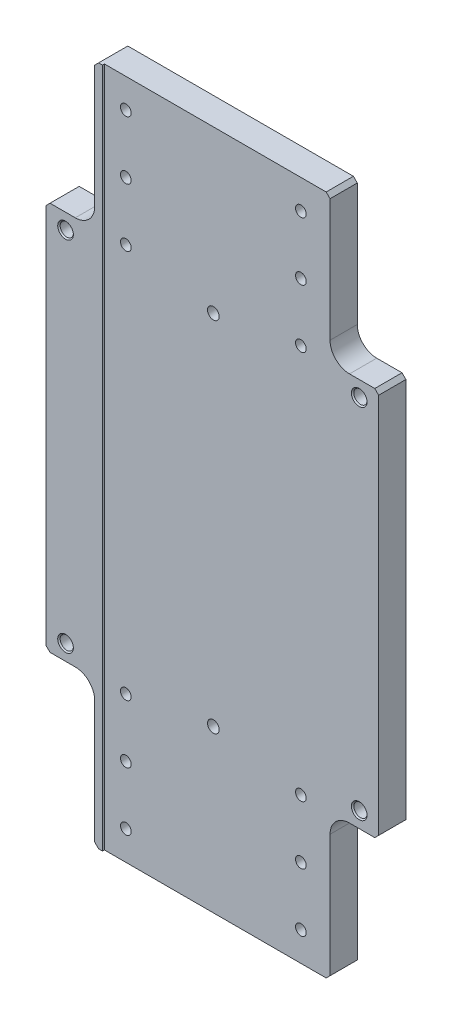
ISO-10303-21;
HEADER;
FILE_DESCRIPTION(('STEP AP214'),'2;1');
FILE_NAME('part.step','',(''),(''),'','','');
FILE_SCHEMA(('AUTOMOTIVE_DESIGN { 1 0 10303 214 1 1 1 1 }'));
ENDSEC;
DATA;
#1=APPLICATION_CONTEXT('core data for automotive mechanical design processes');
#2=APPLICATION_PROTOCOL_DEFINITION('international standard','automotive_design',2000,#1);
#3=PRODUCT_CONTEXT('',#1,'mechanical');
#4=PRODUCT('Part','Part','',(#3));
#5=PRODUCT_RELATED_PRODUCT_CATEGORY('part','',(#4));
#6=PRODUCT_DEFINITION_FORMATION('','',#4);
#7=PRODUCT_DEFINITION_CONTEXT('part definition',#1,'design');
#8=PRODUCT_DEFINITION('design','',#6,#7);
#9=PRODUCT_DEFINITION_SHAPE('','',#8);
#10=(LENGTH_UNIT() NAMED_UNIT(*) SI_UNIT(.MILLI.,.METRE.));
#11=(NAMED_UNIT(*) PLANE_ANGLE_UNIT() SI_UNIT($,.RADIAN.));
#12=(NAMED_UNIT(*) SI_UNIT($,.STERADIAN.) SOLID_ANGLE_UNIT());
#13=UNCERTAINTY_MEASURE_WITH_UNIT(LENGTH_MEASURE(1.E-05),#10,'distance_accuracy_value','');
#14=(GEOMETRIC_REPRESENTATION_CONTEXT(3) GLOBAL_UNCERTAINTY_ASSIGNED_CONTEXT((#13)) GLOBAL_UNIT_ASSIGNED_CONTEXT((#10,
#11,#12)) REPRESENTATION_CONTEXT('',''));
#15=CARTESIAN_POINT('',(0.,0.,0.));
#16=DIRECTION('',(0.,0.,1.));
#17=DIRECTION('',(1.,0.,0.));
#18=AXIS2_PLACEMENT_3D('',#15,#16,#17);
#19=CARTESIAN_POINT('',(60.,-100.,7.5));
#20=DIRECTION('',(-1.,0.,0.));
#21=DIRECTION('',(0.,-1.,0.));
#22=AXIS2_PLACEMENT_3D('',#19,#20,#21);
#23=PLANE('',#22);
#24=DIRECTION('',(0.,1.,0.));
#25=VECTOR('',#24,1.);
#26=CARTESIAN_POINT('',(60.,-100.,6.5));
#27=LINE('',#26,#25);
#28=CARTESIAN_POINT('',(60.,-173.,6.5));
#29=VERTEX_POINT('',#28);
#30=CARTESIAN_POINT('',(60.,-110.,6.5));
#31=VERTEX_POINT('',#30);
#32=EDGE_CURVE('E249',#29,#31,#27,.T.);
#33=ORIENTED_EDGE('',*,*,#32,.F.);
#34=DIRECTION('',(0.,0.,-1.));
#35=VECTOR('',#34,1.);
#36=CARTESIAN_POINT('',(60.,-173.,7.5));
#37=LINE('',#36,#35);
#38=CARTESIAN_POINT('',(60.,-173.,-7.5));
#39=VERTEX_POINT('',#38);
#40=EDGE_CURVE('E419',#29,#39,#37,.T.);
#41=ORIENTED_EDGE('',*,*,#40,.T.);
#42=DIRECTION('',(0.,1.,0.));
#43=VECTOR('',#42,1.);
#44=CARTESIAN_POINT('',(60.,-100.,-7.5));
#45=LINE('',#44,#43);
#46=CARTESIAN_POINT('',(60.,-110.,-7.5));
#47=VERTEX_POINT('',#46);
#48=EDGE_CURVE('E251',#39,#47,#45,.T.);
#49=ORIENTED_EDGE('',*,*,#48,.T.);
#50=DIRECTION('',(0.,0.,-1.));
#51=VECTOR('',#50,1.);
#52=CARTESIAN_POINT('',(60.,-110.,6.5));
#53=LINE('',#52,#51);
#54=EDGE_CURVE('E330',#47,#31,#53,.F.);
#55=ORIENTED_EDGE('',*,*,#54,.T.);
#56=EDGE_LOOP('',(#33,#41,#49,#55));
#57=FACE_BOUND('',#56,.T.);
#58=ADVANCED_FACE('F35',(#57),#23,.F.);
#59=CARTESIAN_POINT('',(85.,-100.,7.5));
#60=DIRECTION('',(0.,1.,0.));
#61=DIRECTION('',(-1.,0.,0.));
#62=AXIS2_PLACEMENT_3D('',#59,#60,#61);
#63=PLANE('',#62);
#64=DIRECTION('',(1.,0.,0.));
#65=VECTOR('',#64,1.);
#66=CARTESIAN_POINT('',(85.,-100.,-7.5));
#67=LINE('',#66,#65);
#68=CARTESIAN_POINT('',(70.,-100.,-7.5));
#69=VERTEX_POINT('',#68);
#70=CARTESIAN_POINT('',(83.,-100.,-7.5));
#71=VERTEX_POINT('',#70);
#72=EDGE_CURVE('E273',#69,#71,#67,.T.);
#73=ORIENTED_EDGE('',*,*,#72,.T.);
#74=DIRECTION('',(0.,0.,1.));
#75=VECTOR('',#74,1.);
#76=CARTESIAN_POINT('',(83.,-100.,7.5));
#77=LINE('',#76,#75);
#78=CARTESIAN_POINT('',(83.,-100.,6.5));
#79=VERTEX_POINT('',#78);
#80=EDGE_CURVE('E434',#71,#79,#77,.T.);
#81=ORIENTED_EDGE('',*,*,#80,.T.);
#82=DIRECTION('',(1.,0.,0.));
#83=VECTOR('',#82,1.);
#84=CARTESIAN_POINT('',(85.,-100.,6.5));
#85=LINE('',#84,#83);
#86=CARTESIAN_POINT('',(70.,-100.,6.5));
#87=VERTEX_POINT('',#86);
#88=EDGE_CURVE('E246',#87,#79,#85,.T.);
#89=ORIENTED_EDGE('',*,*,#88,.F.);
#90=DIRECTION('',(0.,0.,-1.));
#91=VECTOR('',#90,1.);
#92=CARTESIAN_POINT('',(70.,-100.,-7.5));
#93=LINE('',#92,#91);
#94=EDGE_CURVE('E271',#87,#69,#93,.T.);
#95=ORIENTED_EDGE('',*,*,#94,.T.);
#96=EDGE_LOOP('',(#73,#81,#89,#95));
#97=FACE_BOUND('',#96,.T.);
#98=ADVANCED_FACE('F520',(#97),#63,.F.);
#99=CARTESIAN_POINT('',(85.,100.,7.5));
#100=DIRECTION('',(-1.,0.,0.));
#101=DIRECTION('',(0.,0.,1.));
#102=AXIS2_PLACEMENT_3D('',#99,#100,#101);
#103=PLANE('',#102);
#104=DIRECTION('',(0.,1.,0.));
#105=VECTOR('',#104,1.);
#106=CARTESIAN_POINT('',(85.,175.,6.5));
#107=LINE('',#106,#105);
#108=CARTESIAN_POINT('',(85.,-98.,6.5));
#109=VERTEX_POINT('',#108);
#110=CARTESIAN_POINT('',(85.,98.,6.5));
#111=VERTEX_POINT('',#110);
#112=EDGE_CURVE('E233',#109,#111,#107,.T.);
#113=ORIENTED_EDGE('',*,*,#112,.F.);
#114=DIRECTION('',(0.,0.,-1.));
#115=VECTOR('',#114,1.);
#116=CARTESIAN_POINT('',(85.,-98.,7.5));
#117=LINE('',#116,#115);
#118=CARTESIAN_POINT('',(85.,-98.,-7.5));
#119=VERTEX_POINT('',#118);
#120=EDGE_CURVE('E431',#109,#119,#117,.T.);
#121=ORIENTED_EDGE('',*,*,#120,.T.);
#122=DIRECTION('',(0.,1.,0.));
#123=VECTOR('',#122,1.);
#124=CARTESIAN_POINT('',(85.,100.,-7.5));
#125=LINE('',#124,#123);
#126=CARTESIAN_POINT('',(85.,98.,-7.5));
#127=VERTEX_POINT('',#126);
#128=EDGE_CURVE('E276',#119,#127,#125,.T.);
#129=ORIENTED_EDGE('',*,*,#128,.T.);
#130=DIRECTION('',(0.,0.,1.));
#131=VECTOR('',#130,1.);
#132=CARTESIAN_POINT('',(85.,98.,7.5));
#133=LINE('',#132,#131);
#134=EDGE_CURVE('E429',#127,#111,#133,.T.);
#135=ORIENTED_EDGE('',*,*,#134,.T.);
#136=EDGE_LOOP('',(#113,#121,#129,#135));
#137=FACE_BOUND('',#136,.T.);
#138=ADVANCED_FACE('F526',(#137),#103,.F.);
#139=CARTESIAN_POINT('',(60.,100.,7.5));
#140=DIRECTION('',(0.,-1.,0.));
#141=DIRECTION('',(1.,0.,0.));
#142=AXIS2_PLACEMENT_3D('',#139,#140,#141);
#143=PLANE('',#142);
#144=DIRECTION('',(-1.,0.,0.));
#145=VECTOR('',#144,1.);
#146=CARTESIAN_POINT('',(60.,100.,6.5));
#147=LINE('',#146,#145);
#148=CARTESIAN_POINT('',(83.,100.,6.5));
#149=VERTEX_POINT('',#148);
#150=CARTESIAN_POINT('',(70.,100.,6.5));
#151=VERTEX_POINT('',#150);
#152=EDGE_CURVE('E244',#149,#151,#147,.T.);
#153=ORIENTED_EDGE('',*,*,#152,.F.);
#154=DIRECTION('',(0.,0.,-1.));
#155=VECTOR('',#154,1.);
#156=CARTESIAN_POINT('',(83.,100.,7.5));
#157=LINE('',#156,#155);
#158=CARTESIAN_POINT('',(83.,100.,-7.5));
#159=VERTEX_POINT('',#158);
#160=EDGE_CURVE('E43',#149,#159,#157,.T.);
#161=ORIENTED_EDGE('',*,*,#160,.T.);
#162=DIRECTION('',(-1.,0.,0.));
#163=VECTOR('',#162,1.);
#164=CARTESIAN_POINT('',(60.,100.,-7.5));
#165=LINE('',#164,#163);
#166=CARTESIAN_POINT('',(70.,100.,-7.5));
#167=VERTEX_POINT('',#166);
#168=EDGE_CURVE('E279',#159,#167,#165,.T.);
#169=ORIENTED_EDGE('',*,*,#168,.T.);
#170=DIRECTION('',(0.,0.,-1.));
#171=VECTOR('',#170,1.);
#172=CARTESIAN_POINT('',(70.,100.,6.5));
#173=LINE('',#172,#171);
#174=EDGE_CURVE('E348',#167,#151,#173,.F.);
#175=ORIENTED_EDGE('',*,*,#174,.T.);
#176=EDGE_LOOP('',(#153,#161,#169,#175));
#177=FACE_BOUND('',#176,.T.);
#178=ADVANCED_FACE('F439',(#177),#143,.F.);
#179=CARTESIAN_POINT('',(60.,175.,7.5));
#180=DIRECTION('',(-1.,0.,0.));
#181=DIRECTION('',(0.,-1.,0.));
#182=AXIS2_PLACEMENT_3D('',#179,#180,#181);
#183=PLANE('',#182);
#184=DIRECTION('',(0.,1.,0.));
#185=VECTOR('',#184,1.);
#186=CARTESIAN_POINT('',(60.,175.,-7.5));
#187=LINE('',#186,#185);
#188=CARTESIAN_POINT('',(60.,110.,-7.5));
#189=VERTEX_POINT('',#188);
#190=CARTESIAN_POINT('',(60.,173.,-7.5));
#191=VERTEX_POINT('',#190);
#192=EDGE_CURVE('E281',#189,#191,#187,.T.);
#193=ORIENTED_EDGE('',*,*,#192,.T.);
#194=DIRECTION('',(0.,0.,1.));
#195=VECTOR('',#194,1.);
#196=CARTESIAN_POINT('',(60.,173.,7.5));
#197=LINE('',#196,#195);
#198=CARTESIAN_POINT('',(60.,173.,6.5));
#199=VERTEX_POINT('',#198);
#200=EDGE_CURVE('E11',#191,#199,#197,.T.);
#201=ORIENTED_EDGE('',*,*,#200,.T.);
#202=DIRECTION('',(0.,1.,0.));
#203=VECTOR('',#202,1.);
#204=CARTESIAN_POINT('',(60.,175.,6.5));
#205=LINE('',#204,#203);
#206=CARTESIAN_POINT('',(60.,110.,6.5));
#207=VERTEX_POINT('',#206);
#208=EDGE_CURVE('E241',#207,#199,#205,.T.);
#209=ORIENTED_EDGE('',*,*,#208,.F.);
#210=DIRECTION('',(0.,0.,-1.));
#211=VECTOR('',#210,1.);
#212=CARTESIAN_POINT('',(60.,110.,-7.5));
#213=LINE('',#212,#211);
#214=EDGE_CURVE('E345',#207,#189,#213,.T.);
#215=ORIENTED_EDGE('',*,*,#214,.T.);
#216=EDGE_LOOP('',(#193,#201,#209,#215));
#217=FACE_BOUND('',#216,.T.);
#218=ADVANCED_FACE('F452',(#217),#183,.F.);
#219=CARTESIAN_POINT('',(-60.,175.,7.5));
#220=DIRECTION('',(0.,-1.,0.));
#221=DIRECTION('',(0.,0.,-1.));
#222=AXIS2_PLACEMENT_3D('',#219,#220,#221);
#223=PLANE('',#222);
#224=DIRECTION('',(-1.,0.,0.));
#225=VECTOR('',#224,1.);
#226=CARTESIAN_POINT('',(-60.,175.,-7.5));
#227=LINE('',#226,#225);
#228=CARTESIAN_POINT('',(58.,175.,-7.5));
#229=VERTEX_POINT('',#228);
#230=CARTESIAN_POINT('',(-58.,175.,-7.5));
#231=VERTEX_POINT('',#230);
#232=EDGE_CURVE('E283',#229,#231,#227,.T.);
#233=ORIENTED_EDGE('',*,*,#232,.T.);
#234=DIRECTION('',(0.,0.,1.));
#235=VECTOR('',#234,1.);
#236=CARTESIAN_POINT('',(-58.,175.,7.5));
#237=LINE('',#236,#235);
#238=CARTESIAN_POINT('',(-58.,175.,7.5));
#239=VERTEX_POINT('',#238);
#240=EDGE_CURVE('E408',#231,#239,#237,.T.);
#241=ORIENTED_EDGE('',*,*,#240,.T.);
#242=DIRECTION('',(-1.,0.,0.));
#243=VECTOR('',#242,1.);
#244=CARTESIAN_POINT('',(-60.,175.,7.5));
#245=LINE('',#244,#243);
#246=CARTESIAN_POINT('',(-56.,175.,7.5));
#247=VERTEX_POINT('',#246);
#248=EDGE_CURVE('E252',#247,#239,#245,.T.);
#249=ORIENTED_EDGE('',*,*,#248,.F.);
#250=DIRECTION('',(0.,0.,1.));
#251=VECTOR('',#250,1.);
#252=CARTESIAN_POINT('',(-56.,175.,6.5));
#253=LINE('',#252,#251);
#254=CARTESIAN_POINT('',(-56.,175.,6.5));
#255=VERTEX_POINT('',#254);
#256=EDGE_CURVE('E220',#255,#247,#253,.T.);
#257=ORIENTED_EDGE('',*,*,#256,.F.);
#258=DIRECTION('',(-1.,0.,0.));
#259=VECTOR('',#258,1.);
#260=CARTESIAN_POINT('',(-56.,175.,6.5));
#261=LINE('',#260,#259);
#262=CARTESIAN_POINT('',(58.,175.,6.5));
#263=VERTEX_POINT('',#262);
#264=EDGE_CURVE('E221',#263,#255,#261,.T.);
#265=ORIENTED_EDGE('',*,*,#264,.F.);
#266=DIRECTION('',(0.,0.,-1.));
#267=VECTOR('',#266,1.);
#268=CARTESIAN_POINT('',(58.,175.,7.5));
#269=LINE('',#268,#267);
#270=EDGE_CURVE('E405',#263,#229,#269,.T.);
#271=ORIENTED_EDGE('',*,*,#270,.T.);
#272=EDGE_LOOP('',(#233,#241,#249,#257,#265,#271));
#273=FACE_BOUND('',#272,.T.);
#274=ADVANCED_FACE('F456',(#273),#223,.F.);
#275=CARTESIAN_POINT('',(-60.,175.,7.5));
#276=DIRECTION('',(1.,0.,0.));
#277=DIRECTION('',(0.,0.,-1.));
#278=AXIS2_PLACEMENT_3D('',#275,#276,#277);
#279=PLANE('',#278);
#280=DIRECTION('',(0.,-1.,0.));
#281=VECTOR('',#280,1.);
#282=CARTESIAN_POINT('',(-60.,175.,7.5));
#283=LINE('',#282,#281);
#284=CARTESIAN_POINT('',(-60.,173.,7.5));
#285=VERTEX_POINT('',#284);
#286=CARTESIAN_POINT('',(-60.,110.,7.5));
#287=VERTEX_POINT('',#286);
#288=EDGE_CURVE('E255',#285,#287,#283,.T.);
#289=ORIENTED_EDGE('',*,*,#288,.F.);
#290=DIRECTION('',(0.,0.,-1.));
#291=VECTOR('',#290,1.);
#292=CARTESIAN_POINT('',(-60.,173.,7.5));
#293=LINE('',#292,#291);
#294=CARTESIAN_POINT('',(-60.,173.,-7.5));
#295=VERTEX_POINT('',#294);
#296=EDGE_CURVE('E402',#285,#295,#293,.T.);
#297=ORIENTED_EDGE('',*,*,#296,.T.);
#298=DIRECTION('',(0.,-1.,0.));
#299=VECTOR('',#298,1.);
#300=CARTESIAN_POINT('',(-60.,175.,-7.5));
#301=LINE('',#300,#299);
#302=CARTESIAN_POINT('',(-60.,110.,-7.5));
#303=VERTEX_POINT('',#302);
#304=EDGE_CURVE('E286',#295,#303,#301,.T.);
#305=ORIENTED_EDGE('',*,*,#304,.T.);
#306=DIRECTION('',(0.,0.,-1.));
#307=VECTOR('',#306,1.);
#308=CARTESIAN_POINT('',(-60.,110.,7.5));
#309=LINE('',#308,#307);
#310=EDGE_CURVE('E342',#303,#287,#309,.F.);
#311=ORIENTED_EDGE('',*,*,#310,.T.);
#312=EDGE_LOOP('',(#289,#297,#305,#311));
#313=FACE_BOUND('',#312,.T.);
#314=ADVANCED_FACE('F506',(#313),#279,.F.);
#315=CARTESIAN_POINT('',(-60.,100.,7.5));
#316=DIRECTION('',(0.,-1.,0.));
#317=DIRECTION('',(1.,0.,0.));
#318=AXIS2_PLACEMENT_3D('',#315,#316,#317);
#319=PLANE('',#318);
#320=DIRECTION('',(-1.,0.,0.));
#321=VECTOR('',#320,1.);
#322=CARTESIAN_POINT('',(-60.,100.,-7.5));
#323=LINE('',#322,#321);
#324=CARTESIAN_POINT('',(-70.,100.,-7.5));
#325=VERTEX_POINT('',#324);
#326=CARTESIAN_POINT('',(-83.0000000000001,100.,-7.5));
#327=VERTEX_POINT('',#326);
#328=EDGE_CURVE('E288',#325,#327,#323,.T.);
#329=ORIENTED_EDGE('',*,*,#328,.T.);
#330=DIRECTION('',(0.,0.,1.));
#331=VECTOR('',#330,1.);
#332=CARTESIAN_POINT('',(-83.0000000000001,100.,7.5));
#333=LINE('',#332,#331);
#334=CARTESIAN_POINT('',(-83.0000000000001,100.,7.5));
#335=VERTEX_POINT('',#334);
#336=EDGE_CURVE('E392',#327,#335,#333,.T.);
#337=ORIENTED_EDGE('',*,*,#336,.T.);
#338=DIRECTION('',(-1.,0.,0.));
#339=VECTOR('',#338,1.);
#340=CARTESIAN_POINT('',(-60.,100.,7.5));
#341=LINE('',#340,#339);
#342=CARTESIAN_POINT('',(-70.,100.,7.5));
#343=VERTEX_POINT('',#342);
#344=EDGE_CURVE('E258',#343,#335,#341,.T.);
#345=ORIENTED_EDGE('',*,*,#344,.F.);
#346=DIRECTION('',(0.,0.,-1.));
#347=VECTOR('',#346,1.);
#348=CARTESIAN_POINT('',(-70.,100.,-7.5));
#349=LINE('',#348,#347);
#350=EDGE_CURVE('E339',#343,#325,#349,.T.);
#351=ORIENTED_EDGE('',*,*,#350,.T.);
#352=EDGE_LOOP('',(#329,#337,#345,#351));
#353=FACE_BOUND('',#352,.T.);
#354=ADVANCED_FACE('F497',(#353),#319,.F.);
#355=CARTESIAN_POINT('',(-85.,100.,7.5));
#356=DIRECTION('',(1.,0.,0.));
#357=DIRECTION('',(0.,1.,0.));
#358=AXIS2_PLACEMENT_3D('',#355,#356,#357);
#359=PLANE('',#358);
#360=DIRECTION('',(0.,-1.,0.));
#361=VECTOR('',#360,1.);
#362=CARTESIAN_POINT('',(-85.,100.,7.5));
#363=LINE('',#362,#361);
#364=CARTESIAN_POINT('',(-85.,98.,7.5));
#365=VERTEX_POINT('',#364);
#366=CARTESIAN_POINT('',(-85.,-98.,7.5));
#367=VERTEX_POINT('',#366);
#368=EDGE_CURVE('E261',#365,#367,#363,.T.);
#369=ORIENTED_EDGE('',*,*,#368,.F.);
#370=DIRECTION('',(0.,0.,-1.));
#371=VECTOR('',#370,1.);
#372=CARTESIAN_POINT('',(-85.,98.,7.5));
#373=LINE('',#372,#371);
#374=CARTESIAN_POINT('',(-85.,98.,-7.5));
#375=VERTEX_POINT('',#374);
#376=EDGE_CURVE('E373',#365,#375,#373,.T.);
#377=ORIENTED_EDGE('',*,*,#376,.T.);
#378=DIRECTION('',(0.,-1.,0.));
#379=VECTOR('',#378,1.);
#380=CARTESIAN_POINT('',(-85.,100.,-7.5));
#381=LINE('',#380,#379);
#382=CARTESIAN_POINT('',(-85.,-98.,-7.5));
#383=VERTEX_POINT('',#382);
#384=EDGE_CURVE('E291',#375,#383,#381,.T.);
#385=ORIENTED_EDGE('',*,*,#384,.T.);
#386=DIRECTION('',(0.,0.,1.));
#387=VECTOR('',#386,1.);
#388=CARTESIAN_POINT('',(-85.,-98.,7.5));
#389=LINE('',#388,#387);
#390=EDGE_CURVE('E371',#383,#367,#389,.T.);
#391=ORIENTED_EDGE('',*,*,#390,.T.);
#392=EDGE_LOOP('',(#369,#377,#385,#391));
#393=FACE_BOUND('',#392,.T.);
#394=ADVANCED_FACE('F488',(#393),#359,.F.);
#395=CARTESIAN_POINT('',(-85.,-100.,7.5));
#396=DIRECTION('',(0.,1.,0.));
#397=DIRECTION('',(-1.,0.,0.));
#398=AXIS2_PLACEMENT_3D('',#395,#396,#397);
#399=PLANE('',#398);
#400=DIRECTION('',(1.,0.,0.));
#401=VECTOR('',#400,1.);
#402=CARTESIAN_POINT('',(-85.,-100.,7.5));
#403=LINE('',#402,#401);
#404=CARTESIAN_POINT('',(-83.,-100.,7.5));
#405=VERTEX_POINT('',#404);
#406=CARTESIAN_POINT('',(-70.,-100.,7.5));
#407=VERTEX_POINT('',#406);
#408=EDGE_CURVE('E264',#405,#407,#403,.T.);
#409=ORIENTED_EDGE('',*,*,#408,.F.);
#410=DIRECTION('',(0.,0.,-1.));
#411=VECTOR('',#410,1.);
#412=CARTESIAN_POINT('',(-83.,-100.,7.5));
#413=LINE('',#412,#411);
#414=CARTESIAN_POINT('',(-83.,-100.,-7.5));
#415=VERTEX_POINT('',#414);
#416=EDGE_CURVE('E410',#405,#415,#413,.T.);
#417=ORIENTED_EDGE('',*,*,#416,.T.);
#418=DIRECTION('',(1.,0.,0.));
#419=VECTOR('',#418,1.);
#420=CARTESIAN_POINT('',(-85.,-100.,-7.5));
#421=LINE('',#420,#419);
#422=CARTESIAN_POINT('',(-70.,-100.,-7.5));
#423=VERTEX_POINT('',#422);
#424=EDGE_CURVE('E294',#415,#423,#421,.T.);
#425=ORIENTED_EDGE('',*,*,#424,.T.);
#426=DIRECTION('',(0.,0.,-1.));
#427=VECTOR('',#426,1.);
#428=CARTESIAN_POINT('',(-70.,-100.,7.5));
#429=LINE('',#428,#427);
#430=EDGE_CURVE('E336',#423,#407,#429,.F.);
#431=ORIENTED_EDGE('',*,*,#430,.T.);
#432=EDGE_LOOP('',(#409,#417,#425,#431));
#433=FACE_BOUND('',#432,.T.);
#434=ADVANCED_FACE('F480',(#433),#399,.F.);
#435=CARTESIAN_POINT('',(-60.,-100.,7.5));
#436=DIRECTION('',(1.,0.,0.));
#437=DIRECTION('',(0.,0.,-1.));
#438=AXIS2_PLACEMENT_3D('',#435,#436,#437);
#439=PLANE('',#438);
#440=DIRECTION('',(0.,-1.,0.));
#441=VECTOR('',#440,1.);
#442=CARTESIAN_POINT('',(-60.,-100.,-7.5));
#443=LINE('',#442,#441);
#444=CARTESIAN_POINT('',(-60.,-110.,-7.5));
#445=VERTEX_POINT('',#444);
#446=CARTESIAN_POINT('',(-60.,-173.,-7.5));
#447=VERTEX_POINT('',#446);
#448=EDGE_CURVE('E296',#445,#447,#443,.T.);
#449=ORIENTED_EDGE('',*,*,#448,.T.);
#450=DIRECTION('',(0.,0.,1.));
#451=VECTOR('',#450,1.);
#452=CARTESIAN_POINT('',(-60.,-173.,7.5));
#453=LINE('',#452,#451);
#454=CARTESIAN_POINT('',(-60.,-173.,7.5));
#455=VERTEX_POINT('',#454);
#456=EDGE_CURVE('E417',#447,#455,#453,.T.);
#457=ORIENTED_EDGE('',*,*,#456,.T.);
#458=DIRECTION('',(0.,-1.,0.));
#459=VECTOR('',#458,1.);
#460=CARTESIAN_POINT('',(-60.,-100.,7.5));
#461=LINE('',#460,#459);
#462=CARTESIAN_POINT('',(-60.,-110.,7.5));
#463=VERTEX_POINT('',#462);
#464=EDGE_CURVE('E266',#463,#455,#461,.T.);
#465=ORIENTED_EDGE('',*,*,#464,.F.);
#466=DIRECTION('',(0.,0.,-1.));
#467=VECTOR('',#466,1.);
#468=CARTESIAN_POINT('',(-60.,-110.,-7.5));
#469=LINE('',#468,#467);
#470=EDGE_CURVE('E333',#463,#445,#469,.T.);
#471=ORIENTED_EDGE('',*,*,#470,.T.);
#472=EDGE_LOOP('',(#449,#457,#465,#471));
#473=FACE_BOUND('',#472,.T.);
#474=ADVANCED_FACE('F470',(#473),#439,.F.);
#475=CARTESIAN_POINT('',(-60.,-175.,7.5));
#476=DIRECTION('',(0.,1.,0.));
#477=DIRECTION('',(0.,0.,1.));
#478=AXIS2_PLACEMENT_3D('',#475,#476,#477);
#479=PLANE('',#478);
#480=DIRECTION('',(1.,0.,0.));
#481=VECTOR('',#480,1.);
#482=CARTESIAN_POINT('',(-60.,-175.,7.5));
#483=LINE('',#482,#481);
#484=CARTESIAN_POINT('',(-57.9999999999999,-175.,7.5));
#485=VERTEX_POINT('',#484);
#486=CARTESIAN_POINT('',(-56.,-175.,7.5));
#487=VERTEX_POINT('',#486);
#488=EDGE_CURVE('E269',#485,#487,#483,.T.);
#489=ORIENTED_EDGE('',*,*,#488,.F.);
#490=DIRECTION('',(0.,0.,-1.));
#491=VECTOR('',#490,1.);
#492=CARTESIAN_POINT('',(-57.9999999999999,-175.,7.5));
#493=LINE('',#492,#491);
#494=CARTESIAN_POINT('',(-57.9999999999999,-175.,-7.5));
#495=VERTEX_POINT('',#494);
#496=EDGE_CURVE('E414',#485,#495,#493,.T.);
#497=ORIENTED_EDGE('',*,*,#496,.T.);
#498=DIRECTION('',(1.,0.,0.));
#499=VECTOR('',#498,1.);
#500=CARTESIAN_POINT('',(-60.,-175.,-7.5));
#501=LINE('',#500,#499);
#502=CARTESIAN_POINT('',(58.0000000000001,-175.,-7.5));
#503=VERTEX_POINT('',#502);
#504=EDGE_CURVE('E256',#495,#503,#501,.T.);
#505=ORIENTED_EDGE('',*,*,#504,.T.);
#506=DIRECTION('',(0.,0.,1.));
#507=VECTOR('',#506,1.);
#508=CARTESIAN_POINT('',(58.0000000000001,-175.,7.5));
#509=LINE('',#508,#507);
#510=CARTESIAN_POINT('',(58.0000000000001,-175.,6.5));
#511=VERTEX_POINT('',#510);
#512=EDGE_CURVE('E232',#503,#511,#509,.T.);
#513=ORIENTED_EDGE('',*,*,#512,.T.);
#514=DIRECTION('',(1.,0.,0.));
#515=VECTOR('',#514,1.);
#516=CARTESIAN_POINT('',(-56.,-175.,6.5));
#517=LINE('',#516,#515);
#518=CARTESIAN_POINT('',(-56.,-175.,6.5));
#519=VERTEX_POINT('',#518);
#520=EDGE_CURVE('E225',#519,#511,#517,.T.);
#521=ORIENTED_EDGE('',*,*,#520,.F.);
#522=DIRECTION('',(0.,0.,1.));
#523=VECTOR('',#522,1.);
#524=CARTESIAN_POINT('',(-56.,-175.,6.5));
#525=LINE('',#524,#523);
#526=EDGE_CURVE('E210',#519,#487,#525,.T.);
#527=ORIENTED_EDGE('',*,*,#526,.T.);
#528=EDGE_LOOP('',(#489,#497,#505,#513,#521,#527));
#529=FACE_BOUND('',#528,.T.);
#530=ADVANCED_FACE('F229',(#529),#479,.F.);
#531=CARTESIAN_POINT('',(0.,0.,7.5));
#532=DIRECTION('',(0.,0.,1.));
#533=DIRECTION('',(1.,0.,0.));
#534=AXIS2_PLACEMENT_3D('',#531,#532,#533);
#535=PLANE('',#534);
#536=CARTESIAN_POINT('',(-75.,92.,7.5));
#537=DIRECTION('',(0.,0.,1.));
#538=DIRECTION('',(1.,0.,0.));
#539=AXIS2_PLACEMENT_3D('',#536,#537,#538);
#540=CIRCLE('',#539,4.025);
#541=CARTESIAN_POINT('',(-70.975,92.,7.5));
#542=VERTEX_POINT('',#541);
#543=EDGE_CURVE('E1440',#542,#542,#540,.T.);
#544=ORIENTED_EDGE('',*,*,#543,.F.);
#545=EDGE_LOOP('',(#544));
#546=FACE_BOUND('',#545,.T.);
#547=CARTESIAN_POINT('',(-75.,-92.,7.5));
#548=DIRECTION('',(0.,0.,1.));
#549=DIRECTION('',(1.,0.,0.));
#550=AXIS2_PLACEMENT_3D('',#547,#548,#549);
#551=CIRCLE('',#550,4.025);
#552=CARTESIAN_POINT('',(-70.975,-92.,7.5));
#553=VERTEX_POINT('',#552);
#554=EDGE_CURVE('E1428',#553,#553,#551,.T.);
#555=ORIENTED_EDGE('',*,*,#554,.F.);
#556=EDGE_LOOP('',(#555));
#557=FACE_BOUND('',#556,.T.);
#558=ORIENTED_EDGE('',*,*,#344,.T.);
#559=DIRECTION('',(0.707106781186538,0.707106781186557,0.));
#560=VECTOR('',#559,1.);
#561=CARTESIAN_POINT('',(-91.5000000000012,91.4999999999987,7.5));
#562=LINE('',#561,#560);
#563=EDGE_CURVE('E400',#335,#365,#562,.F.);
#564=ORIENTED_EDGE('',*,*,#563,.T.);
#565=ORIENTED_EDGE('',*,*,#368,.T.);
#566=DIRECTION('',(-0.707106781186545,0.70710678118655,0.));
#567=VECTOR('',#566,1.);
#568=CARTESIAN_POINT('',(-91.5000000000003,-91.4999999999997,7.5));
#569=LINE('',#568,#567);
#570=EDGE_CURVE('E396',#367,#405,#569,.F.);
#571=ORIENTED_EDGE('',*,*,#570,.T.);
#572=ORIENTED_EDGE('',*,*,#408,.T.);
#573=CARTESIAN_POINT('',(-70.,-110.,7.5));
#574=DIRECTION('',(0.,0.,1.));
#575=DIRECTION('',(1.,0.,0.));
#576=AXIS2_PLACEMENT_3D('',#573,#574,#575);
#577=CIRCLE('',#576,10.);
#578=EDGE_CURVE('E359',#407,#463,#577,.F.);
#579=ORIENTED_EDGE('',*,*,#578,.T.);
#580=ORIENTED_EDGE('',*,*,#464,.T.);
#581=DIRECTION('',(-0.707106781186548,0.707106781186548,0.));
#582=VECTOR('',#581,1.);
#583=CARTESIAN_POINT('',(-116.5,-116.5,7.5));
#584=LINE('',#583,#582);
#585=EDGE_CURVE('E394',#455,#485,#584,.F.);
#586=ORIENTED_EDGE('',*,*,#585,.T.);
#587=ORIENTED_EDGE('',*,*,#488,.T.);
#588=DIRECTION('',(0.,-1.,0.));
#589=VECTOR('',#588,1.);
#590=CARTESIAN_POINT('',(-56.,175.,7.5));
#591=LINE('',#590,#589);
#592=EDGE_CURVE('E216',#247,#487,#591,.T.);
#593=ORIENTED_EDGE('',*,*,#592,.F.);
#594=ORIENTED_EDGE('',*,*,#248,.T.);
#595=DIRECTION('',(0.707106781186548,0.707106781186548,0.));
#596=VECTOR('',#595,1.);
#597=CARTESIAN_POINT('',(-116.5,116.5,7.5));
#598=LINE('',#597,#596);
#599=EDGE_CURVE('E398',#239,#285,#598,.F.);
#600=ORIENTED_EDGE('',*,*,#599,.T.);
#601=ORIENTED_EDGE('',*,*,#288,.T.);
#602=CARTESIAN_POINT('',(-70.,110.,7.5));
#603=DIRECTION('',(0.,0.,1.));
#604=DIRECTION('',(1.,0.,0.));
#605=AXIS2_PLACEMENT_3D('',#602,#603,#604);
#606=CIRCLE('',#605,10.);
#607=EDGE_CURVE('E364',#287,#343,#606,.F.);
#608=ORIENTED_EDGE('',*,*,#607,.T.);
#609=EDGE_LOOP('',(#558,#564,#565,#571,#572,#579,#580,#586,#587,#593,#594,#600,#601,#608));
#610=FACE_BOUND('',#609,.T.);
#611=ADVANCED_FACE('F460',(#546,#557,#610),#535,.T.);
#612=CARTESIAN_POINT('',(0.,0.,-7.5));
#613=DIRECTION('',(0.,0.,1.));
#614=DIRECTION('',(1.,0.,0.));
#615=AXIS2_PLACEMENT_3D('',#612,#613,#614);
#616=PLANE('',#615);
#617=CARTESIAN_POINT('',(-75.,92.,-7.5));
#618=DIRECTION('',(0.,0.,1.));
#619=DIRECTION('',(1.,0.,0.));
#620=AXIS2_PLACEMENT_3D('',#617,#618,#619);
#621=CIRCLE('',#620,4.025);
#622=CARTESIAN_POINT('',(-70.975,92.,-7.5));
#623=VERTEX_POINT('',#622);
#624=EDGE_CURVE('E1443',#623,#623,#621,.T.);
#625=ORIENTED_EDGE('',*,*,#624,.T.);
#626=EDGE_LOOP('',(#625));
#627=FACE_BOUND('',#626,.T.);
#628=CARTESIAN_POINT('',(-75.,-92.,-7.5));
#629=DIRECTION('',(0.,0.,1.));
#630=DIRECTION('',(1.,0.,0.));
#631=AXIS2_PLACEMENT_3D('',#628,#629,#630);
#632=CIRCLE('',#631,4.025);
#633=CARTESIAN_POINT('',(-70.975,-92.,-7.5));
#634=VERTEX_POINT('',#633);
#635=EDGE_CURVE('E1431',#634,#634,#632,.T.);
#636=ORIENTED_EDGE('',*,*,#635,.T.);
#637=EDGE_LOOP('',(#636));
#638=FACE_BOUND('',#637,.T.);
#639=CARTESIAN_POINT('',(75.,92.,-7.5));
#640=DIRECTION('',(0.,0.,1.));
#641=DIRECTION('',(1.,0.,0.));
#642=AXIS2_PLACEMENT_3D('',#639,#640,#641);
#643=CIRCLE('',#642,4.025);
#644=CARTESIAN_POINT('',(79.025,92.,-7.5));
#645=VERTEX_POINT('',#644);
#646=EDGE_CURVE('E1419',#645,#645,#643,.T.);
#647=ORIENTED_EDGE('',*,*,#646,.T.);
#648=EDGE_LOOP('',(#647));
#649=FACE_BOUND('',#648,.T.);
#650=CARTESIAN_POINT('',(75.,-92.,-7.5));
#651=DIRECTION('',(0.,0.,1.));
#652=DIRECTION('',(1.,0.,0.));
#653=AXIS2_PLACEMENT_3D('',#650,#651,#652);
#654=CIRCLE('',#653,4.025);
#655=CARTESIAN_POINT('',(79.025,-92.,-7.5));
#656=VERTEX_POINT('',#655);
#657=EDGE_CURVE('E1407',#656,#656,#654,.T.);
#658=ORIENTED_EDGE('',*,*,#657,.T.);
#659=EDGE_LOOP('',(#658));
#660=FACE_BOUND('',#659,.T.);
#661=CARTESIAN_POINT('',(0.,92.,-7.5));
#662=DIRECTION('',(0.,0.,1.));
#663=DIRECTION('',(1.,0.,0.));
#664=AXIS2_PLACEMENT_3D('',#661,#662,#663);
#665=CIRCLE('',#664,3.);
#666=CARTESIAN_POINT('',(3.,92.,-7.5));
#667=VERTEX_POINT('',#666);
#668=EDGE_CURVE('E1392',#667,#667,#665,.T.);
#669=ORIENTED_EDGE('',*,*,#668,.T.);
#670=EDGE_LOOP('',(#669));
#671=FACE_BOUND('',#670,.T.);
#672=CARTESIAN_POINT('',(0.,-92.,-7.5));
#673=DIRECTION('',(0.,0.,1.));
#674=DIRECTION('',(1.,0.,0.));
#675=AXIS2_PLACEMENT_3D('',#672,#673,#674);
#676=CIRCLE('',#675,3.);
#677=CARTESIAN_POINT('',(3.,-92.,-7.5));
#678=VERTEX_POINT('',#677);
#679=EDGE_CURVE('E1386',#678,#678,#676,.T.);
#680=ORIENTED_EDGE('',*,*,#679,.T.);
#681=EDGE_LOOP('',(#680));
#682=FACE_BOUND('',#681,.T.);
#683=CARTESIAN_POINT('',(-45.,-100.,-7.5));
#684=DIRECTION('',(0.,0.,-1.));
#685=DIRECTION('',(-1.,0.,0.));
#686=AXIS2_PLACEMENT_3D('',#683,#684,#685);
#687=CIRCLE('',#686,4.75);
#688=CARTESIAN_POINT('',(-49.75,-100.,-7.5));
#689=VERTEX_POINT('',#688);
#690=EDGE_CURVE('E1383',#689,#689,#687,.T.);
#691=ORIENTED_EDGE('',*,*,#690,.F.);
#692=EDGE_LOOP('',(#691));
#693=FACE_BOUND('',#692,.T.);
#694=CARTESIAN_POINT('',(45.,-130.,-7.5));
#695=DIRECTION('',(0.,0.,-1.));
#696=DIRECTION('',(-1.,0.,0.));
#697=AXIS2_PLACEMENT_3D('',#694,#695,#696);
#698=CIRCLE('',#697,4.75);
#699=CARTESIAN_POINT('',(40.25,-130.,-7.5));
#700=VERTEX_POINT('',#699);
#701=EDGE_CURVE('E1371',#700,#700,#698,.T.);
#702=ORIENTED_EDGE('',*,*,#701,.F.);
#703=EDGE_LOOP('',(#702));
#704=FACE_BOUND('',#703,.T.);
#705=CARTESIAN_POINT('',(-45.,-130.,-7.5));
#706=DIRECTION('',(0.,0.,-1.));
#707=DIRECTION('',(-1.,0.,0.));
#708=AXIS2_PLACEMENT_3D('',#705,#706,#707);
#709=CIRCLE('',#708,4.75);
#710=CARTESIAN_POINT('',(-49.75,-130.,-7.5));
#711=VERTEX_POINT('',#710);
#712=EDGE_CURVE('E1359',#711,#711,#709,.T.);
#713=ORIENTED_EDGE('',*,*,#712,.F.);
#714=EDGE_LOOP('',(#713));
#715=FACE_BOUND('',#714,.T.);
#716=CARTESIAN_POINT('',(45.,-160.,-7.5));
#717=DIRECTION('',(0.,0.,-1.));
#718=DIRECTION('',(-1.,0.,0.));
#719=AXIS2_PLACEMENT_3D('',#716,#717,#718);
#720=CIRCLE('',#719,4.75);
#721=CARTESIAN_POINT('',(40.25,-160.,-7.5));
#722=VERTEX_POINT('',#721);
#723=EDGE_CURVE('E1347',#722,#722,#720,.T.);
#724=ORIENTED_EDGE('',*,*,#723,.F.);
#725=EDGE_LOOP('',(#724));
#726=FACE_BOUND('',#725,.T.);
#727=CARTESIAN_POINT('',(-45.,-160.,-7.5));
#728=DIRECTION('',(0.,0.,-1.));
#729=DIRECTION('',(-1.,0.,0.));
#730=AXIS2_PLACEMENT_3D('',#727,#728,#729);
#731=CIRCLE('',#730,4.75);
#732=CARTESIAN_POINT('',(-49.75,-160.,-7.5));
#733=VERTEX_POINT('',#732);
#734=EDGE_CURVE('E1335',#733,#733,#731,.T.);
#735=ORIENTED_EDGE('',*,*,#734,.F.);
#736=EDGE_LOOP('',(#735));
#737=FACE_BOUND('',#736,.T.);
#738=CARTESIAN_POINT('',(45.,-100.,-7.5));
#739=DIRECTION('',(0.,0.,-1.));
#740=DIRECTION('',(-1.,0.,0.));
#741=AXIS2_PLACEMENT_3D('',#738,#739,#740);
#742=CIRCLE('',#741,4.75);
#743=CARTESIAN_POINT('',(40.25,-100.,-7.5));
#744=VERTEX_POINT('',#743);
#745=EDGE_CURVE('E1323',#744,#744,#742,.T.);
#746=ORIENTED_EDGE('',*,*,#745,.F.);
#747=EDGE_LOOP('',(#746));
#748=FACE_BOUND('',#747,.T.);
#749=CARTESIAN_POINT('',(45.,160.,-7.5));
#750=DIRECTION('',(0.,0.,-1.));
#751=DIRECTION('',(-1.,0.,0.));
#752=AXIS2_PLACEMENT_3D('',#749,#750,#751);
#753=CIRCLE('',#752,4.75);
#754=CARTESIAN_POINT('',(40.25,160.,-7.5));
#755=VERTEX_POINT('',#754);
#756=EDGE_CURVE('E1311',#755,#755,#753,.T.);
#757=ORIENTED_EDGE('',*,*,#756,.F.);
#758=EDGE_LOOP('',(#757));
#759=FACE_BOUND('',#758,.T.);
#760=CARTESIAN_POINT('',(-45.,160.,-7.5));
#761=DIRECTION('',(0.,0.,-1.));
#762=DIRECTION('',(-1.,0.,0.));
#763=AXIS2_PLACEMENT_3D('',#760,#761,#762);
#764=CIRCLE('',#763,4.75);
#765=CARTESIAN_POINT('',(-49.75,160.,-7.5));
#766=VERTEX_POINT('',#765);
#767=EDGE_CURVE('E326',#766,#766,#764,.T.);
#768=ORIENTED_EDGE('',*,*,#767,.F.);
#769=EDGE_LOOP('',(#768));
#770=FACE_BOUND('',#769,.T.);
#771=CARTESIAN_POINT('',(45.,130.,-7.5));
#772=DIRECTION('',(0.,0.,-1.));
#773=DIRECTION('',(-1.,0.,0.));
#774=AXIS2_PLACEMENT_3D('',#771,#772,#773);
#775=CIRCLE('',#774,4.75);
#776=CARTESIAN_POINT('',(40.25,130.,-7.5));
#777=VERTEX_POINT('',#776);
#778=EDGE_CURVE('E321',#777,#777,#775,.T.);
#779=ORIENTED_EDGE('',*,*,#778,.F.);
#780=EDGE_LOOP('',(#779));
#781=FACE_BOUND('',#780,.T.);
#782=CARTESIAN_POINT('',(-45.,130.,-7.5));
#783=DIRECTION('',(0.,0.,-1.));
#784=DIRECTION('',(-1.,0.,0.));
#785=AXIS2_PLACEMENT_3D('',#782,#783,#784);
#786=CIRCLE('',#785,4.75);
#787=CARTESIAN_POINT('',(-49.75,130.,-7.5));
#788=VERTEX_POINT('',#787);
#789=EDGE_CURVE('E316',#788,#788,#786,.T.);
#790=ORIENTED_EDGE('',*,*,#789,.F.);
#791=EDGE_LOOP('',(#790));
#792=FACE_BOUND('',#791,.T.);
#793=CARTESIAN_POINT('',(45.,100.,-7.5));
#794=DIRECTION('',(0.,0.,-1.));
#795=DIRECTION('',(-1.,0.,0.));
#796=AXIS2_PLACEMENT_3D('',#793,#794,#795);
#797=CIRCLE('',#796,4.75);
#798=CARTESIAN_POINT('',(40.25,100.,-7.5));
#799=VERTEX_POINT('',#798);
#800=EDGE_CURVE('E311',#799,#799,#797,.T.);
#801=ORIENTED_EDGE('',*,*,#800,.F.);
#802=EDGE_LOOP('',(#801));
#803=FACE_BOUND('',#802,.T.);
#804=CARTESIAN_POINT('',(-45.,100.,-7.5));
#805=DIRECTION('',(0.,0.,-1.));
#806=DIRECTION('',(-1.,0.,0.));
#807=AXIS2_PLACEMENT_3D('',#804,#805,#806);
#808=CIRCLE('',#807,4.75);
#809=CARTESIAN_POINT('',(-49.75,100.,-7.5));
#810=VERTEX_POINT('',#809);
#811=EDGE_CURVE('E306',#810,#810,#808,.T.);
#812=ORIENTED_EDGE('',*,*,#811,.F.);
#813=EDGE_LOOP('',(#812));
#814=FACE_BOUND('',#813,.T.);
#815=ORIENTED_EDGE('',*,*,#384,.F.);
#816=DIRECTION('',(-0.707106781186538,-0.707106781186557,0.));
#817=VECTOR('',#816,1.);
#818=CARTESIAN_POINT('',(-85.,98.,-7.5));
#819=LINE('',#818,#817);
#820=EDGE_CURVE('E390',#375,#327,#819,.F.);
#821=ORIENTED_EDGE('',*,*,#820,.T.);
#822=ORIENTED_EDGE('',*,*,#328,.F.);
#823=CARTESIAN_POINT('',(-70.,110.,-7.5));
#824=DIRECTION('',(0.,0.,1.));
#825=DIRECTION('',(1.,0.,0.));
#826=AXIS2_PLACEMENT_3D('',#823,#824,#825);
#827=CIRCLE('',#826,10.);
#828=EDGE_CURVE('E361',#325,#303,#827,.T.);
#829=ORIENTED_EDGE('',*,*,#828,.T.);
#830=ORIENTED_EDGE('',*,*,#304,.F.);
#831=DIRECTION('',(-0.707106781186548,-0.707106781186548,0.));
#832=VECTOR('',#831,1.);
#833=CARTESIAN_POINT('',(-60.,173.,-7.5));
#834=LINE('',#833,#832);
#835=EDGE_CURVE('E388',#295,#231,#834,.F.);
#836=ORIENTED_EDGE('',*,*,#835,.T.);
#837=ORIENTED_EDGE('',*,*,#232,.F.);
#838=DIRECTION('',(-0.707106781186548,0.707106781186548,0.));
#839=VECTOR('',#838,1.);
#840=CARTESIAN_POINT('',(58.,175.,-7.5));
#841=LINE('',#840,#839);
#842=EDGE_CURVE('E376',#229,#191,#841,.F.);
#843=ORIENTED_EDGE('',*,*,#842,.T.);
#844=ORIENTED_EDGE('',*,*,#192,.F.);
#845=CARTESIAN_POINT('',(70.,110.,-7.5));
#846=DIRECTION('',(0.,0.,1.));
#847=DIRECTION('',(1.,0.,0.));
#848=AXIS2_PLACEMENT_3D('',#845,#846,#847);
#849=CIRCLE('',#848,10.);
#850=EDGE_CURVE('E366',#189,#167,#849,.T.);
#851=ORIENTED_EDGE('',*,*,#850,.T.);
#852=ORIENTED_EDGE('',*,*,#168,.F.);
#853=DIRECTION('',(-0.707106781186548,0.707106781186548,0.));
#854=VECTOR('',#853,1.);
#855=CARTESIAN_POINT('',(83.,100.,-7.5));
#856=LINE('',#855,#854);
#857=EDGE_CURVE('E378',#159,#127,#856,.F.);
#858=ORIENTED_EDGE('',*,*,#857,.T.);
#859=ORIENTED_EDGE('',*,*,#128,.F.);
#860=DIRECTION('',(0.707106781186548,0.707106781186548,0.));
#861=VECTOR('',#860,1.);
#862=CARTESIAN_POINT('',(85.,-98.,-7.5));
#863=LINE('',#862,#861);
#864=EDGE_CURVE('E380',#119,#71,#863,.F.);
#865=ORIENTED_EDGE('',*,*,#864,.T.);
#866=ORIENTED_EDGE('',*,*,#72,.F.);
#867=CARTESIAN_POINT('',(70.,-110.,-7.5));
#868=DIRECTION('',(0.,0.,1.));
#869=DIRECTION('',(1.,0.,0.));
#870=AXIS2_PLACEMENT_3D('',#867,#868,#869);
#871=CIRCLE('',#870,10.);
#872=EDGE_CURVE('E351',#69,#47,#871,.T.);
#873=ORIENTED_EDGE('',*,*,#872,.T.);
#874=ORIENTED_EDGE('',*,*,#48,.F.);
#875=DIRECTION('',(0.707106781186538,0.707106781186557,0.));
#876=VECTOR('',#875,1.);
#877=CARTESIAN_POINT('',(60.,-173.,-7.5));
#878=LINE('',#877,#876);
#879=EDGE_CURVE('E382',#39,#503,#878,.F.);
#880=ORIENTED_EDGE('',*,*,#879,.T.);
#881=ORIENTED_EDGE('',*,*,#504,.F.);
#882=DIRECTION('',(0.707106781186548,-0.707106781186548,0.));
#883=VECTOR('',#882,1.);
#884=CARTESIAN_POINT('',(-57.9999999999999,-175.,-7.5));
#885=LINE('',#884,#883);
#886=EDGE_CURVE('E384',#495,#447,#885,.F.);
#887=ORIENTED_EDGE('',*,*,#886,.T.);
#888=ORIENTED_EDGE('',*,*,#448,.F.);
#889=CARTESIAN_POINT('',(-70.,-110.,-7.5));
#890=DIRECTION('',(0.,0.,1.));
#891=DIRECTION('',(1.,0.,0.));
#892=AXIS2_PLACEMENT_3D('',#889,#890,#891);
#893=CIRCLE('',#892,10.);
#894=EDGE_CURVE('E356',#445,#423,#893,.T.);
#895=ORIENTED_EDGE('',*,*,#894,.T.);
#896=ORIENTED_EDGE('',*,*,#424,.F.);
#897=DIRECTION('',(0.707106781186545,-0.70710678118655,0.));
#898=VECTOR('',#897,1.);
#899=CARTESIAN_POINT('',(-83.,-100.,-7.5));
#900=LINE('',#899,#898);
#901=EDGE_CURVE('E386',#415,#383,#900,.F.);
#902=ORIENTED_EDGE('',*,*,#901,.T.);
#903=EDGE_LOOP('',(#815,#821,#822,#829,#830,#836,#837,#843,#844,#851,#852,#858,#859,#865,#866,
#873,#874,#880,#881,#887,#888,#895,#896,#902));
#904=FACE_BOUND('',#903,.T.);
#905=ADVANCED_FACE('F443',(#627,#638,#649,#660,#671,#682,#693,#704,#715,#726,#737,#748,#759,
#770,#781,#792,#803,#814,#904),#616,.F.);
#906=CARTESIAN_POINT('',(0.,0.,6.5));
#907=DIRECTION('',(0.,0.,1.));
#908=DIRECTION('',(1.,0.,0.));
#909=AXIS2_PLACEMENT_3D('',#906,#907,#908);
#910=PLANE('',#909);
#911=CARTESIAN_POINT('',(75.,92.,6.5));
#912=DIRECTION('',(0.,0.,1.));
#913=DIRECTION('',(1.,0.,0.));
#914=AXIS2_PLACEMENT_3D('',#911,#912,#913);
#915=CIRCLE('',#914,4.025);
#916=CARTESIAN_POINT('',(79.025,92.,6.5));
#917=VERTEX_POINT('',#916);
#918=EDGE_CURVE('E1416',#917,#917,#915,.T.);
#919=ORIENTED_EDGE('',*,*,#918,.F.);
#920=EDGE_LOOP('',(#919));
#921=FACE_BOUND('',#920,.T.);
#922=CARTESIAN_POINT('',(75.,-92.,6.5));
#923=DIRECTION('',(0.,0.,1.));
#924=DIRECTION('',(1.,0.,0.));
#925=AXIS2_PLACEMENT_3D('',#922,#923,#924);
#926=CIRCLE('',#925,4.025);
#927=CARTESIAN_POINT('',(79.025,-92.,6.5));
#928=VERTEX_POINT('',#927);
#929=EDGE_CURVE('E1404',#928,#928,#926,.T.);
#930=ORIENTED_EDGE('',*,*,#929,.F.);
#931=EDGE_LOOP('',(#930));
#932=FACE_BOUND('',#931,.T.);
#933=CARTESIAN_POINT('',(0.,92.,6.5));
#934=DIRECTION('',(0.,0.,1.));
#935=DIRECTION('',(1.,0.,0.));
#936=AXIS2_PLACEMENT_3D('',#933,#934,#935);
#937=CIRCLE('',#936,2.99999999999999);
#938=CARTESIAN_POINT('',(2.99999999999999,92.,6.5));
#939=VERTEX_POINT('',#938);
#940=EDGE_CURVE('E1395',#939,#939,#937,.T.);
#941=ORIENTED_EDGE('',*,*,#940,.F.);
#942=EDGE_LOOP('',(#941));
#943=FACE_BOUND('',#942,.T.);
#944=CARTESIAN_POINT('',(0.,-92.,6.5));
#945=DIRECTION('',(0.,0.,1.));
#946=DIRECTION('',(1.,0.,0.));
#947=AXIS2_PLACEMENT_3D('',#944,#945,#946);
#948=CIRCLE('',#947,2.99999999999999);
#949=CARTESIAN_POINT('',(2.99999999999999,-92.,6.5));
#950=VERTEX_POINT('',#949);
#951=EDGE_CURVE('E1389',#950,#950,#948,.T.);
#952=ORIENTED_EDGE('',*,*,#951,.F.);
#953=EDGE_LOOP('',(#952));
#954=FACE_BOUND('',#953,.T.);
#955=CARTESIAN_POINT('',(-45.,-100.,6.5));
#956=DIRECTION('',(0.,0.,1.));
#957=DIRECTION('',(1.,0.,0.));
#958=AXIS2_PLACEMENT_3D('',#955,#956,#957);
#959=CIRCLE('',#958,2.75);
#960=CARTESIAN_POINT('',(-42.25,-100.,6.5));
#961=VERTEX_POINT('',#960);
#962=EDGE_CURVE('E1380',#961,#961,#959,.T.);
#963=ORIENTED_EDGE('',*,*,#962,.F.);
#964=EDGE_LOOP('',(#963));
#965=FACE_BOUND('',#964,.T.);
#966=CARTESIAN_POINT('',(45.,-130.,6.5));
#967=DIRECTION('',(0.,0.,1.));
#968=DIRECTION('',(1.,0.,0.));
#969=AXIS2_PLACEMENT_3D('',#966,#967,#968);
#970=CIRCLE('',#969,2.75);
#971=CARTESIAN_POINT('',(47.75,-130.,6.5));
#972=VERTEX_POINT('',#971);
#973=EDGE_CURVE('E1368',#972,#972,#970,.T.);
#974=ORIENTED_EDGE('',*,*,#973,.F.);
#975=EDGE_LOOP('',(#974));
#976=FACE_BOUND('',#975,.T.);
#977=CARTESIAN_POINT('',(-45.,-130.,6.5));
#978=DIRECTION('',(0.,0.,1.));
#979=DIRECTION('',(1.,0.,0.));
#980=AXIS2_PLACEMENT_3D('',#977,#978,#979);
#981=CIRCLE('',#980,2.75);
#982=CARTESIAN_POINT('',(-42.25,-130.,6.5));
#983=VERTEX_POINT('',#982);
#984=EDGE_CURVE('E1356',#983,#983,#981,.T.);
#985=ORIENTED_EDGE('',*,*,#984,.F.);
#986=EDGE_LOOP('',(#985));
#987=FACE_BOUND('',#986,.T.);
#988=CARTESIAN_POINT('',(45.,-160.,6.5));
#989=DIRECTION('',(0.,0.,1.));
#990=DIRECTION('',(1.,0.,0.));
#991=AXIS2_PLACEMENT_3D('',#988,#989,#990);
#992=CIRCLE('',#991,2.75);
#993=CARTESIAN_POINT('',(47.75,-160.,6.5));
#994=VERTEX_POINT('',#993);
#995=EDGE_CURVE('E1344',#994,#994,#992,.T.);
#996=ORIENTED_EDGE('',*,*,#995,.F.);
#997=EDGE_LOOP('',(#996));
#998=FACE_BOUND('',#997,.T.);
#999=CARTESIAN_POINT('',(-45.,-160.,6.5));
#1000=DIRECTION('',(0.,0.,1.));
#1001=DIRECTION('',(1.,0.,0.));
#1002=AXIS2_PLACEMENT_3D('',#999,#1000,#1001);
#1003=CIRCLE('',#1002,2.75);
#1004=CARTESIAN_POINT('',(-42.25,-160.,6.5));
#1005=VERTEX_POINT('',#1004);
#1006=EDGE_CURVE('E1332',#1005,#1005,#1003,.T.);
#1007=ORIENTED_EDGE('',*,*,#1006,.F.);
#1008=EDGE_LOOP('',(#1007));
#1009=FACE_BOUND('',#1008,.T.);
#1010=CARTESIAN_POINT('',(45.,-100.,6.5));
#1011=DIRECTION('',(0.,0.,1.));
#1012=DIRECTION('',(1.,0.,0.));
#1013=AXIS2_PLACEMENT_3D('',#1010,#1011,#1012);
#1014=CIRCLE('',#1013,2.75);
#1015=CARTESIAN_POINT('',(47.75,-100.,6.5));
#1016=VERTEX_POINT('',#1015);
#1017=EDGE_CURVE('E1320',#1016,#1016,#1014,.T.);
#1018=ORIENTED_EDGE('',*,*,#1017,.F.);
#1019=EDGE_LOOP('',(#1018));
#1020=FACE_BOUND('',#1019,.T.);
#1021=CARTESIAN_POINT('',(45.,160.,6.5));
#1022=DIRECTION('',(0.,0.,1.));
#1023=DIRECTION('',(1.,0.,0.));
#1024=AXIS2_PLACEMENT_3D('',#1021,#1022,#1023);
#1025=CIRCLE('',#1024,2.75);
#1026=CARTESIAN_POINT('',(47.75,160.,6.5));
#1027=VERTEX_POINT('',#1026);
#1028=EDGE_CURVE('E323',#1027,#1027,#1025,.T.);
#1029=ORIENTED_EDGE('',*,*,#1028,.F.);
#1030=EDGE_LOOP('',(#1029));
#1031=FACE_BOUND('',#1030,.T.);
#1032=CARTESIAN_POINT('',(-45.,160.,6.5));
#1033=DIRECTION('',(0.,0.,1.));
#1034=DIRECTION('',(1.,0.,0.));
#1035=AXIS2_PLACEMENT_3D('',#1032,#1033,#1034);
#1036=CIRCLE('',#1035,2.75);
#1037=CARTESIAN_POINT('',(-42.25,160.,6.5));
#1038=VERTEX_POINT('',#1037);
#1039=EDGE_CURVE('E318',#1038,#1038,#1036,.T.);
#1040=ORIENTED_EDGE('',*,*,#1039,.F.);
#1041=EDGE_LOOP('',(#1040));
#1042=FACE_BOUND('',#1041,.T.);
#1043=CARTESIAN_POINT('',(45.,130.,6.5));
#1044=DIRECTION('',(0.,0.,1.));
#1045=DIRECTION('',(1.,0.,0.));
#1046=AXIS2_PLACEMENT_3D('',#1043,#1044,#1045);
#1047=CIRCLE('',#1046,2.75);
#1048=CARTESIAN_POINT('',(47.75,130.,6.5));
#1049=VERTEX_POINT('',#1048);
#1050=EDGE_CURVE('E313',#1049,#1049,#1047,.T.);
#1051=ORIENTED_EDGE('',*,*,#1050,.F.);
#1052=EDGE_LOOP('',(#1051));
#1053=FACE_BOUND('',#1052,.T.);
#1054=CARTESIAN_POINT('',(-45.,130.,6.5));
#1055=DIRECTION('',(0.,0.,1.));
#1056=DIRECTION('',(1.,0.,0.));
#1057=AXIS2_PLACEMENT_3D('',#1054,#1055,#1056);
#1058=CIRCLE('',#1057,2.75);
#1059=CARTESIAN_POINT('',(-42.25,130.,6.5));
#1060=VERTEX_POINT('',#1059);
#1061=EDGE_CURVE('E308',#1060,#1060,#1058,.T.);
#1062=ORIENTED_EDGE('',*,*,#1061,.F.);
#1063=EDGE_LOOP('',(#1062));
#1064=FACE_BOUND('',#1063,.T.);
#1065=CARTESIAN_POINT('',(45.,100.,6.5));
#1066=DIRECTION('',(0.,0.,1.));
#1067=DIRECTION('',(1.,0.,0.));
#1068=AXIS2_PLACEMENT_3D('',#1065,#1066,#1067);
#1069=CIRCLE('',#1068,2.75);
#1070=CARTESIAN_POINT('',(47.75,100.,6.5));
#1071=VERTEX_POINT('',#1070);
#1072=EDGE_CURVE('E303',#1071,#1071,#1069,.T.);
#1073=ORIENTED_EDGE('',*,*,#1072,.F.);
#1074=EDGE_LOOP('',(#1073));
#1075=FACE_BOUND('',#1074,.T.);
#1076=CARTESIAN_POINT('',(-45.,100.,6.5));
#1077=DIRECTION('',(0.,0.,1.));
#1078=DIRECTION('',(1.,0.,0.));
#1079=AXIS2_PLACEMENT_3D('',#1076,#1077,#1078);
#1080=CIRCLE('',#1079,2.75);
#1081=CARTESIAN_POINT('',(-42.25,100.,6.5));
#1082=VERTEX_POINT('',#1081);
#1083=EDGE_CURVE('E240',#1082,#1082,#1080,.T.);
#1084=ORIENTED_EDGE('',*,*,#1083,.F.);
#1085=EDGE_LOOP('',(#1084));
#1086=FACE_BOUND('',#1085,.T.);
#1087=ORIENTED_EDGE('',*,*,#520,.T.);
#1088=DIRECTION('',(-0.707106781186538,-0.707106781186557,0.));
#1089=VECTOR('',#1088,1.);
#1090=CARTESIAN_POINT('',(116.500000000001,-116.499999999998,6.5));
#1091=LINE('',#1090,#1089);
#1092=EDGE_CURVE('E427',#511,#29,#1091,.F.);
#1093=ORIENTED_EDGE('',*,*,#1092,.T.);
#1094=ORIENTED_EDGE('',*,*,#32,.T.);
#1095=CARTESIAN_POINT('',(70.,-110.,6.5));
#1096=DIRECTION('',(0.,0.,1.));
#1097=DIRECTION('',(1.,0.,0.));
#1098=AXIS2_PLACEMENT_3D('',#1095,#1096,#1097);
#1099=CIRCLE('',#1098,10.);
#1100=EDGE_CURVE('E354',#31,#87,#1099,.F.);
#1101=ORIENTED_EDGE('',*,*,#1100,.T.);
#1102=ORIENTED_EDGE('',*,*,#88,.T.);
#1103=DIRECTION('',(-0.707106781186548,-0.707106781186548,0.));
#1104=VECTOR('',#1103,1.);
#1105=CARTESIAN_POINT('',(91.5,-91.5,6.5));
#1106=LINE('',#1105,#1104);
#1107=EDGE_CURVE('E425',#79,#109,#1106,.F.);
#1108=ORIENTED_EDGE('',*,*,#1107,.T.);
#1109=ORIENTED_EDGE('',*,*,#112,.T.);
#1110=DIRECTION('',(0.707106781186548,-0.707106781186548,0.));
#1111=VECTOR('',#1110,1.);
#1112=CARTESIAN_POINT('',(91.5,91.5,6.5));
#1113=LINE('',#1112,#1111);
#1114=EDGE_CURVE('E56',#111,#149,#1113,.F.);
#1115=ORIENTED_EDGE('',*,*,#1114,.T.);
#1116=ORIENTED_EDGE('',*,*,#152,.T.);
#1117=CARTESIAN_POINT('',(70.,110.,6.5));
#1118=DIRECTION('',(0.,0.,1.));
#1119=DIRECTION('',(1.,0.,0.));
#1120=AXIS2_PLACEMENT_3D('',#1117,#1118,#1119);
#1121=CIRCLE('',#1120,10.);
#1122=EDGE_CURVE('E369',#151,#207,#1121,.F.);
#1123=ORIENTED_EDGE('',*,*,#1122,.T.);
#1124=ORIENTED_EDGE('',*,*,#208,.T.);
#1125=DIRECTION('',(0.707106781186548,-0.707106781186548,0.));
#1126=VECTOR('',#1125,1.);
#1127=CARTESIAN_POINT('',(116.5,116.5,6.5));
#1128=LINE('',#1127,#1126);
#1129=EDGE_CURVE('E422',#199,#263,#1128,.F.);
#1130=ORIENTED_EDGE('',*,*,#1129,.T.);
#1131=ORIENTED_EDGE('',*,*,#264,.T.);
#1132=DIRECTION('',(0.,-1.,0.));
#1133=VECTOR('',#1132,1.);
#1134=CARTESIAN_POINT('',(-56.,175.,6.5));
#1135=LINE('',#1134,#1133);
#1136=EDGE_CURVE('E213',#255,#519,#1135,.T.);
#1137=ORIENTED_EDGE('',*,*,#1136,.T.);
#1138=EDGE_LOOP('',(#1087,#1093,#1094,#1101,#1102,#1108,#1109,#1115,#1116,#1123,#1124,#1130,
#1131,#1137));
#1139=FACE_BOUND('',#1138,.T.);
#1140=ADVANCED_FACE('F224',(#921,#932,#943,#954,#965,#976,#987,#998,#1009,#1020,#1031,#1042,
#1053,#1064,#1075,#1086,#1139),#910,.T.);
#1141=CARTESIAN_POINT('',(-56.,175.,6.5));
#1142=DIRECTION('',(-1.,0.,0.));
#1143=DIRECTION('',(0.,-1.,0.));
#1144=AXIS2_PLACEMENT_3D('',#1141,#1142,#1143);
#1145=PLANE('',#1144);
#1146=ORIENTED_EDGE('',*,*,#592,.T.);
#1147=ORIENTED_EDGE('',*,*,#526,.F.);
#1148=ORIENTED_EDGE('',*,*,#1136,.F.);
#1149=ORIENTED_EDGE('',*,*,#256,.T.);
#1150=EDGE_LOOP('',(#1146,#1147,#1148,#1149));
#1151=FACE_BOUND('',#1150,.T.);
#1152=ADVANCED_FACE('F212',(#1151),#1145,.F.);
#1153=CARTESIAN_POINT('',(-45.,100.,-7.5));
#1154=DIRECTION('',(0.,0.,-1.));
#1155=DIRECTION('',(-1.,0.,0.));
#1156=AXIS2_PLACEMENT_3D('',#1153,#1154,#1155);
#1157=CYLINDRICAL_SURFACE('',#1156,2.75);
#1158=ORIENTED_EDGE('',*,*,#1083,.T.);
#1159=EDGE_LOOP('',(#1158));
#1160=FACE_BOUND('',#1159,.T.);
#1161=CARTESIAN_POINT('',(-45.,100.,-0.5));
#1162=DIRECTION('',(0.,0.,-1.));
#1163=DIRECTION('',(-1.,0.,0.));
#1164=AXIS2_PLACEMENT_3D('',#1161,#1162,#1163);
#1165=CIRCLE('',#1164,2.75);
#1166=CARTESIAN_POINT('',(-47.75,100.,-0.5));
#1167=VERTEX_POINT('',#1166);
#1168=EDGE_CURVE('E302',#1167,#1167,#1165,.T.);
#1169=ORIENTED_EDGE('',*,*,#1168,.T.);
#1170=EDGE_LOOP('',(#1169));
#1171=FACE_BOUND('',#1170,.T.);
#1172=ADVANCED_FACE('F917',(#1160,#1171),#1157,.F.);
#1173=CARTESIAN_POINT('',(-42.25,100.,-0.5));
#1174=DIRECTION('',(0.,0.,1.));
#1175=DIRECTION('',(1.,0.,0.));
#1176=AXIS2_PLACEMENT_3D('',#1173,#1174,#1175);
#1177=PLANE('',#1176);
#1178=ORIENTED_EDGE('',*,*,#1168,.F.);
#1179=EDGE_LOOP('',(#1178));
#1180=FACE_BOUND('',#1179,.T.);
#1181=CARTESIAN_POINT('',(-45.,100.,-0.5));
#1182=DIRECTION('',(0.,0.,-1.));
#1183=DIRECTION('',(-1.,0.,0.));
#1184=AXIS2_PLACEMENT_3D('',#1181,#1182,#1183);
#1185=CIRCLE('',#1184,4.75);
#1186=CARTESIAN_POINT('',(-49.75,100.,-0.5));
#1187=VERTEX_POINT('',#1186);
#1188=EDGE_CURVE('E1272',#1187,#1187,#1185,.T.);
#1189=ORIENTED_EDGE('',*,*,#1188,.T.);
#1190=EDGE_LOOP('',(#1189));
#1191=FACE_BOUND('',#1190,.T.);
#1192=ADVANCED_FACE('F913',(#1180,#1191),#1177,.F.);
#1193=CARTESIAN_POINT('',(-45.,100.,-7.5));
#1194=DIRECTION('',(0.,0.,-1.));
#1195=DIRECTION('',(-1.,0.,0.));
#1196=AXIS2_PLACEMENT_3D('',#1193,#1194,#1195);
#1197=CYLINDRICAL_SURFACE('',#1196,4.75);
#1198=ORIENTED_EDGE('',*,*,#1188,.F.);
#1199=EDGE_LOOP('',(#1198));
#1200=FACE_BOUND('',#1199,.T.);
#1201=ORIENTED_EDGE('',*,*,#811,.T.);
#1202=EDGE_LOOP('',(#1201));
#1203=FACE_BOUND('',#1202,.T.);
#1204=ADVANCED_FACE('F909',(#1200,#1203),#1197,.F.);
#1205=CARTESIAN_POINT('',(45.,100.,-7.5));
#1206=DIRECTION('',(0.,0.,-1.));
#1207=DIRECTION('',(-1.,0.,0.));
#1208=AXIS2_PLACEMENT_3D('',#1205,#1206,#1207);
#1209=CYLINDRICAL_SURFACE('',#1208,2.75);
#1210=ORIENTED_EDGE('',*,*,#1072,.T.);
#1211=EDGE_LOOP('',(#1210));
#1212=FACE_BOUND('',#1211,.T.);
#1213=CARTESIAN_POINT('',(45.,100.,-0.5));
#1214=DIRECTION('',(0.,0.,-1.));
#1215=DIRECTION('',(-1.,0.,0.));
#1216=AXIS2_PLACEMENT_3D('',#1213,#1214,#1215);
#1217=CIRCLE('',#1216,2.75);
#1218=CARTESIAN_POINT('',(42.25,100.,-0.5));
#1219=VERTEX_POINT('',#1218);
#1220=EDGE_CURVE('E307',#1219,#1219,#1217,.T.);
#1221=ORIENTED_EDGE('',*,*,#1220,.T.);
#1222=EDGE_LOOP('',(#1221));
#1223=FACE_BOUND('',#1222,.T.);
#1224=ADVANCED_FACE('F905',(#1212,#1223),#1209,.F.);
#1225=CARTESIAN_POINT('',(47.75,100.,-0.5));
#1226=DIRECTION('',(0.,0.,1.));
#1227=DIRECTION('',(1.,0.,0.));
#1228=AXIS2_PLACEMENT_3D('',#1225,#1226,#1227);
#1229=PLANE('',#1228);
#1230=ORIENTED_EDGE('',*,*,#1220,.F.);
#1231=EDGE_LOOP('',(#1230));
#1232=FACE_BOUND('',#1231,.T.);
#1233=CARTESIAN_POINT('',(45.,100.,-0.5));
#1234=DIRECTION('',(0.,0.,-1.));
#1235=DIRECTION('',(-1.,0.,0.));
#1236=AXIS2_PLACEMENT_3D('',#1233,#1234,#1235);
#1237=CIRCLE('',#1236,4.75);
#1238=CARTESIAN_POINT('',(40.25,100.,-0.5));
#1239=VERTEX_POINT('',#1238);
#1240=EDGE_CURVE('E1280',#1239,#1239,#1237,.T.);
#1241=ORIENTED_EDGE('',*,*,#1240,.T.);
#1242=EDGE_LOOP('',(#1241));
#1243=FACE_BOUND('',#1242,.T.);
#1244=ADVANCED_FACE('F901',(#1232,#1243),#1229,.F.);
#1245=CARTESIAN_POINT('',(45.,100.,-7.5));
#1246=DIRECTION('',(0.,0.,-1.));
#1247=DIRECTION('',(-1.,0.,0.));
#1248=AXIS2_PLACEMENT_3D('',#1245,#1246,#1247);
#1249=CYLINDRICAL_SURFACE('',#1248,4.75);
#1250=ORIENTED_EDGE('',*,*,#1240,.F.);
#1251=EDGE_LOOP('',(#1250));
#1252=FACE_BOUND('',#1251,.T.);
#1253=ORIENTED_EDGE('',*,*,#800,.T.);
#1254=EDGE_LOOP('',(#1253));
#1255=FACE_BOUND('',#1254,.T.);
#1256=ADVANCED_FACE('F897',(#1252,#1255),#1249,.F.);
#1257=CARTESIAN_POINT('',(-45.,130.,-7.5));
#1258=DIRECTION('',(0.,0.,-1.));
#1259=DIRECTION('',(-1.,0.,0.));
#1260=AXIS2_PLACEMENT_3D('',#1257,#1258,#1259);
#1261=CYLINDRICAL_SURFACE('',#1260,2.75);
#1262=ORIENTED_EDGE('',*,*,#1061,.T.);
#1263=EDGE_LOOP('',(#1262));
#1264=FACE_BOUND('',#1263,.T.);
#1265=CARTESIAN_POINT('',(-45.,130.,-0.5));
#1266=DIRECTION('',(0.,0.,-1.));
#1267=DIRECTION('',(-1.,0.,0.));
#1268=AXIS2_PLACEMENT_3D('',#1265,#1266,#1267);
#1269=CIRCLE('',#1268,2.75);
#1270=CARTESIAN_POINT('',(-47.75,130.,-0.5));
#1271=VERTEX_POINT('',#1270);
#1272=EDGE_CURVE('E312',#1271,#1271,#1269,.T.);
#1273=ORIENTED_EDGE('',*,*,#1272,.T.);
#1274=EDGE_LOOP('',(#1273));
#1275=FACE_BOUND('',#1274,.T.);
#1276=ADVANCED_FACE('F893',(#1264,#1275),#1261,.F.);
#1277=CARTESIAN_POINT('',(-42.25,130.,-0.5));
#1278=DIRECTION('',(0.,0.,1.));
#1279=DIRECTION('',(1.,0.,0.));
#1280=AXIS2_PLACEMENT_3D('',#1277,#1278,#1279);
#1281=PLANE('',#1280);
#1282=ORIENTED_EDGE('',*,*,#1272,.F.);
#1283=EDGE_LOOP('',(#1282));
#1284=FACE_BOUND('',#1283,.T.);
#1285=CARTESIAN_POINT('',(-45.,130.,-0.5));
#1286=DIRECTION('',(0.,0.,-1.));
#1287=DIRECTION('',(-1.,0.,0.));
#1288=AXIS2_PLACEMENT_3D('',#1285,#1286,#1287);
#1289=CIRCLE('',#1288,4.75);
#1290=CARTESIAN_POINT('',(-49.75,130.,-0.5));
#1291=VERTEX_POINT('',#1290);
#1292=EDGE_CURVE('E1287',#1291,#1291,#1289,.T.);
#1293=ORIENTED_EDGE('',*,*,#1292,.T.);
#1294=EDGE_LOOP('',(#1293));
#1295=FACE_BOUND('',#1294,.T.);
#1296=ADVANCED_FACE('F889',(#1284,#1295),#1281,.F.);
#1297=CARTESIAN_POINT('',(-45.,130.,-7.5));
#1298=DIRECTION('',(0.,0.,-1.));
#1299=DIRECTION('',(-1.,0.,0.));
#1300=AXIS2_PLACEMENT_3D('',#1297,#1298,#1299);
#1301=CYLINDRICAL_SURFACE('',#1300,4.75);
#1302=ORIENTED_EDGE('',*,*,#1292,.F.);
#1303=EDGE_LOOP('',(#1302));
#1304=FACE_BOUND('',#1303,.T.);
#1305=ORIENTED_EDGE('',*,*,#789,.T.);
#1306=EDGE_LOOP('',(#1305));
#1307=FACE_BOUND('',#1306,.T.);
#1308=ADVANCED_FACE('F885',(#1304,#1307),#1301,.F.);
#1309=CARTESIAN_POINT('',(45.,130.,-7.5));
#1310=DIRECTION('',(0.,0.,-1.));
#1311=DIRECTION('',(-1.,0.,0.));
#1312=AXIS2_PLACEMENT_3D('',#1309,#1310,#1311);
#1313=CYLINDRICAL_SURFACE('',#1312,2.75);
#1314=ORIENTED_EDGE('',*,*,#1050,.T.);
#1315=EDGE_LOOP('',(#1314));
#1316=FACE_BOUND('',#1315,.T.);
#1317=CARTESIAN_POINT('',(45.,130.,-0.5));
#1318=DIRECTION('',(0.,0.,-1.));
#1319=DIRECTION('',(-1.,0.,0.));
#1320=AXIS2_PLACEMENT_3D('',#1317,#1318,#1319);
#1321=CIRCLE('',#1320,2.75);
#1322=CARTESIAN_POINT('',(42.25,130.,-0.5));
#1323=VERTEX_POINT('',#1322);
#1324=EDGE_CURVE('E317',#1323,#1323,#1321,.T.);
#1325=ORIENTED_EDGE('',*,*,#1324,.T.);
#1326=EDGE_LOOP('',(#1325));
#1327=FACE_BOUND('',#1326,.T.);
#1328=ADVANCED_FACE('F881',(#1316,#1327),#1313,.F.);
#1329=CARTESIAN_POINT('',(47.75,130.,-0.5));
#1330=DIRECTION('',(0.,0.,1.));
#1331=DIRECTION('',(1.,0.,0.));
#1332=AXIS2_PLACEMENT_3D('',#1329,#1330,#1331);
#1333=PLANE('',#1332);
#1334=ORIENTED_EDGE('',*,*,#1324,.F.);
#1335=EDGE_LOOP('',(#1334));
#1336=FACE_BOUND('',#1335,.T.);
#1337=CARTESIAN_POINT('',(45.,130.,-0.5));
#1338=DIRECTION('',(0.,0.,-1.));
#1339=DIRECTION('',(-1.,0.,0.));
#1340=AXIS2_PLACEMENT_3D('',#1337,#1338,#1339);
#1341=CIRCLE('',#1340,4.75);
#1342=CARTESIAN_POINT('',(40.25,130.,-0.5));
#1343=VERTEX_POINT('',#1342);
#1344=EDGE_CURVE('E1294',#1343,#1343,#1341,.T.);
#1345=ORIENTED_EDGE('',*,*,#1344,.T.);
#1346=EDGE_LOOP('',(#1345));
#1347=FACE_BOUND('',#1346,.T.);
#1348=ADVANCED_FACE('F877',(#1336,#1347),#1333,.F.);
#1349=CARTESIAN_POINT('',(45.,130.,-7.5));
#1350=DIRECTION('',(0.,0.,-1.));
#1351=DIRECTION('',(-1.,0.,0.));
#1352=AXIS2_PLACEMENT_3D('',#1349,#1350,#1351);
#1353=CYLINDRICAL_SURFACE('',#1352,4.75);
#1354=ORIENTED_EDGE('',*,*,#1344,.F.);
#1355=EDGE_LOOP('',(#1354));
#1356=FACE_BOUND('',#1355,.T.);
#1357=ORIENTED_EDGE('',*,*,#778,.T.);
#1358=EDGE_LOOP('',(#1357));
#1359=FACE_BOUND('',#1358,.T.);
#1360=ADVANCED_FACE('F873',(#1356,#1359),#1353,.F.);
#1361=CARTESIAN_POINT('',(-45.,160.,-7.5));
#1362=DIRECTION('',(0.,0.,-1.));
#1363=DIRECTION('',(-1.,0.,0.));
#1364=AXIS2_PLACEMENT_3D('',#1361,#1362,#1363);
#1365=CYLINDRICAL_SURFACE('',#1364,2.75);
#1366=ORIENTED_EDGE('',*,*,#1039,.T.);
#1367=EDGE_LOOP('',(#1366));
#1368=FACE_BOUND('',#1367,.T.);
#1369=CARTESIAN_POINT('',(-45.,160.,-0.5));
#1370=DIRECTION('',(0.,0.,-1.));
#1371=DIRECTION('',(-1.,0.,0.));
#1372=AXIS2_PLACEMENT_3D('',#1369,#1370,#1371);
#1373=CIRCLE('',#1372,2.75);
#1374=CARTESIAN_POINT('',(-47.75,160.,-0.5));
#1375=VERTEX_POINT('',#1374);
#1376=EDGE_CURVE('E322',#1375,#1375,#1373,.T.);
#1377=ORIENTED_EDGE('',*,*,#1376,.T.);
#1378=EDGE_LOOP('',(#1377));
#1379=FACE_BOUND('',#1378,.T.);
#1380=ADVANCED_FACE('F869',(#1368,#1379),#1365,.F.);
#1381=CARTESIAN_POINT('',(-42.25,160.,-0.5));
#1382=DIRECTION('',(0.,0.,1.));
#1383=DIRECTION('',(1.,0.,0.));
#1384=AXIS2_PLACEMENT_3D('',#1381,#1382,#1383);
#1385=PLANE('',#1384);
#1386=ORIENTED_EDGE('',*,*,#1376,.F.);
#1387=EDGE_LOOP('',(#1386));
#1388=FACE_BOUND('',#1387,.T.);
#1389=CARTESIAN_POINT('',(-45.,160.,-0.5));
#1390=DIRECTION('',(0.,0.,-1.));
#1391=DIRECTION('',(-1.,0.,0.));
#1392=AXIS2_PLACEMENT_3D('',#1389,#1390,#1391);
#1393=CIRCLE('',#1392,4.75);
#1394=CARTESIAN_POINT('',(-49.75,160.,-0.5));
#1395=VERTEX_POINT('',#1394);
#1396=EDGE_CURVE('E1301',#1395,#1395,#1393,.T.);
#1397=ORIENTED_EDGE('',*,*,#1396,.T.);
#1398=EDGE_LOOP('',(#1397));
#1399=FACE_BOUND('',#1398,.T.);
#1400=ADVANCED_FACE('F865',(#1388,#1399),#1385,.F.);
#1401=CARTESIAN_POINT('',(-45.,160.,-7.5));
#1402=DIRECTION('',(0.,0.,-1.));
#1403=DIRECTION('',(-1.,0.,0.));
#1404=AXIS2_PLACEMENT_3D('',#1401,#1402,#1403);
#1405=CYLINDRICAL_SURFACE('',#1404,4.75);
#1406=ORIENTED_EDGE('',*,*,#1396,.F.);
#1407=EDGE_LOOP('',(#1406));
#1408=FACE_BOUND('',#1407,.T.);
#1409=ORIENTED_EDGE('',*,*,#767,.T.);
#1410=EDGE_LOOP('',(#1409));
#1411=FACE_BOUND('',#1410,.T.);
#1412=ADVANCED_FACE('F861',(#1408,#1411),#1405,.F.);
#1413=CARTESIAN_POINT('',(45.,160.,-7.5));
#1414=DIRECTION('',(0.,0.,-1.));
#1415=DIRECTION('',(-1.,0.,0.));
#1416=AXIS2_PLACEMENT_3D('',#1413,#1414,#1415);
#1417=CYLINDRICAL_SURFACE('',#1416,2.75);
#1418=ORIENTED_EDGE('',*,*,#1028,.T.);
#1419=EDGE_LOOP('',(#1418));
#1420=FACE_BOUND('',#1419,.T.);
#1421=CARTESIAN_POINT('',(45.,160.,-0.5));
#1422=DIRECTION('',(0.,0.,-1.));
#1423=DIRECTION('',(-1.,0.,0.));
#1424=AXIS2_PLACEMENT_3D('',#1421,#1422,#1423);
#1425=CIRCLE('',#1424,2.75);
#1426=CARTESIAN_POINT('',(42.25,160.,-0.5));
#1427=VERTEX_POINT('',#1426);
#1428=EDGE_CURVE('E327',#1427,#1427,#1425,.T.);
#1429=ORIENTED_EDGE('',*,*,#1428,.T.);
#1430=EDGE_LOOP('',(#1429));
#1431=FACE_BOUND('',#1430,.T.);
#1432=ADVANCED_FACE('F857',(#1420,#1431),#1417,.F.);
#1433=CARTESIAN_POINT('',(47.75,160.,-0.5));
#1434=DIRECTION('',(0.,0.,1.));
#1435=DIRECTION('',(1.,0.,0.));
#1436=AXIS2_PLACEMENT_3D('',#1433,#1434,#1435);
#1437=PLANE('',#1436);
#1438=ORIENTED_EDGE('',*,*,#1428,.F.);
#1439=EDGE_LOOP('',(#1438));
#1440=FACE_BOUND('',#1439,.T.);
#1441=CARTESIAN_POINT('',(45.,160.,-0.5));
#1442=DIRECTION('',(0.,0.,-1.));
#1443=DIRECTION('',(-1.,0.,0.));
#1444=AXIS2_PLACEMENT_3D('',#1441,#1442,#1443);
#1445=CIRCLE('',#1444,4.75);
#1446=CARTESIAN_POINT('',(40.25,160.,-0.5));
#1447=VERTEX_POINT('',#1446);
#1448=EDGE_CURVE('E1308',#1447,#1447,#1445,.T.);
#1449=ORIENTED_EDGE('',*,*,#1448,.T.);
#1450=EDGE_LOOP('',(#1449));
#1451=FACE_BOUND('',#1450,.T.);
#1452=ADVANCED_FACE('F853',(#1440,#1451),#1437,.F.);
#1453=CARTESIAN_POINT('',(45.,160.,-7.5));
#1454=DIRECTION('',(0.,0.,-1.));
#1455=DIRECTION('',(-1.,0.,0.));
#1456=AXIS2_PLACEMENT_3D('',#1453,#1454,#1455);
#1457=CYLINDRICAL_SURFACE('',#1456,4.75);
#1458=ORIENTED_EDGE('',*,*,#1448,.F.);
#1459=EDGE_LOOP('',(#1458));
#1460=FACE_BOUND('',#1459,.T.);
#1461=ORIENTED_EDGE('',*,*,#756,.T.);
#1462=EDGE_LOOP('',(#1461));
#1463=FACE_BOUND('',#1462,.T.);
#1464=ADVANCED_FACE('F849',(#1460,#1463),#1457,.F.);
#1465=CARTESIAN_POINT('',(45.,-100.,-7.5));
#1466=DIRECTION('',(0.,0.,-1.));
#1467=DIRECTION('',(-1.,0.,0.));
#1468=AXIS2_PLACEMENT_3D('',#1465,#1466,#1467);
#1469=CYLINDRICAL_SURFACE('',#1468,2.75);
#1470=ORIENTED_EDGE('',*,*,#1017,.T.);
#1471=EDGE_LOOP('',(#1470));
#1472=FACE_BOUND('',#1471,.T.);
#1473=CARTESIAN_POINT('',(45.,-100.,-0.5));
#1474=DIRECTION('',(0.,0.,-1.));
#1475=DIRECTION('',(-1.,0.,0.));
#1476=AXIS2_PLACEMENT_3D('',#1473,#1474,#1475);
#1477=CIRCLE('',#1476,2.75);
#1478=CARTESIAN_POINT('',(42.25,-100.,-0.5));
#1479=VERTEX_POINT('',#1478);
#1480=EDGE_CURVE('E1314',#1479,#1479,#1477,.T.);
#1481=ORIENTED_EDGE('',*,*,#1480,.T.);
#1482=EDGE_LOOP('',(#1481));
#1483=FACE_BOUND('',#1482,.T.);
#1484=ADVANCED_FACE('F845',(#1472,#1483),#1469,.F.);
#1485=CARTESIAN_POINT('',(47.75,-100.,-0.5));
#1486=DIRECTION('',(0.,0.,1.));
#1487=DIRECTION('',(1.,0.,0.));
#1488=AXIS2_PLACEMENT_3D('',#1485,#1486,#1487);
#1489=PLANE('',#1488);
#1490=ORIENTED_EDGE('',*,*,#1480,.F.);
#1491=EDGE_LOOP('',(#1490));
#1492=FACE_BOUND('',#1491,.T.);
#1493=CARTESIAN_POINT('',(45.,-100.,-0.5));
#1494=DIRECTION('',(0.,0.,-1.));
#1495=DIRECTION('',(-1.,0.,0.));
#1496=AXIS2_PLACEMENT_3D('',#1493,#1494,#1495);
#1497=CIRCLE('',#1496,4.75);
#1498=CARTESIAN_POINT('',(40.25,-100.,-0.5));
#1499=VERTEX_POINT('',#1498);
#1500=EDGE_CURVE('E1317',#1499,#1499,#1497,.T.);
#1501=ORIENTED_EDGE('',*,*,#1500,.T.);
#1502=EDGE_LOOP('',(#1501));
#1503=FACE_BOUND('',#1502,.T.);
#1504=ADVANCED_FACE('F841',(#1492,#1503),#1489,.F.);
#1505=CARTESIAN_POINT('',(45.,-100.,-7.5));
#1506=DIRECTION('',(0.,0.,-1.));
#1507=DIRECTION('',(-1.,0.,0.));
#1508=AXIS2_PLACEMENT_3D('',#1505,#1506,#1507);
#1509=CYLINDRICAL_SURFACE('',#1508,4.75);
#1510=ORIENTED_EDGE('',*,*,#1500,.F.);
#1511=EDGE_LOOP('',(#1510));
#1512=FACE_BOUND('',#1511,.T.);
#1513=ORIENTED_EDGE('',*,*,#745,.T.);
#1514=EDGE_LOOP('',(#1513));
#1515=FACE_BOUND('',#1514,.T.);
#1516=ADVANCED_FACE('F837',(#1512,#1515),#1509,.F.);
#1517=CARTESIAN_POINT('',(-45.,-160.,-7.5));
#1518=DIRECTION('',(0.,0.,-1.));
#1519=DIRECTION('',(-1.,0.,0.));
#1520=AXIS2_PLACEMENT_3D('',#1517,#1518,#1519);
#1521=CYLINDRICAL_SURFACE('',#1520,2.75);
#1522=ORIENTED_EDGE('',*,*,#1006,.T.);
#1523=EDGE_LOOP('',(#1522));
#1524=FACE_BOUND('',#1523,.T.);
#1525=CARTESIAN_POINT('',(-45.,-160.,-0.5));
#1526=DIRECTION('',(0.,0.,-1.));
#1527=DIRECTION('',(-1.,0.,0.));
#1528=AXIS2_PLACEMENT_3D('',#1525,#1526,#1527);
#1529=CIRCLE('',#1528,2.75);
#1530=CARTESIAN_POINT('',(-47.75,-160.,-0.5));
#1531=VERTEX_POINT('',#1530);
#1532=EDGE_CURVE('E1326',#1531,#1531,#1529,.T.);
#1533=ORIENTED_EDGE('',*,*,#1532,.T.);
#1534=EDGE_LOOP('',(#1533));
#1535=FACE_BOUND('',#1534,.T.);
#1536=ADVANCED_FACE('F833',(#1524,#1535),#1521,.F.);
#1537=CARTESIAN_POINT('',(-42.25,-160.,-0.5));
#1538=DIRECTION('',(0.,0.,1.));
#1539=DIRECTION('',(1.,0.,0.));
#1540=AXIS2_PLACEMENT_3D('',#1537,#1538,#1539);
#1541=PLANE('',#1540);
#1542=ORIENTED_EDGE('',*,*,#1532,.F.);
#1543=EDGE_LOOP('',(#1542));
#1544=FACE_BOUND('',#1543,.T.);
#1545=CARTESIAN_POINT('',(-45.,-160.,-0.5));
#1546=DIRECTION('',(0.,0.,-1.));
#1547=DIRECTION('',(-1.,0.,0.));
#1548=AXIS2_PLACEMENT_3D('',#1545,#1546,#1547);
#1549=CIRCLE('',#1548,4.75);
#1550=CARTESIAN_POINT('',(-49.75,-160.,-0.5));
#1551=VERTEX_POINT('',#1550);
#1552=EDGE_CURVE('E1329',#1551,#1551,#1549,.T.);
#1553=ORIENTED_EDGE('',*,*,#1552,.T.);
#1554=EDGE_LOOP('',(#1553));
#1555=FACE_BOUND('',#1554,.T.);
#1556=ADVANCED_FACE('F829',(#1544,#1555),#1541,.F.);
#1557=CARTESIAN_POINT('',(-45.,-160.,-7.5));
#1558=DIRECTION('',(0.,0.,-1.));
#1559=DIRECTION('',(-1.,0.,0.));
#1560=AXIS2_PLACEMENT_3D('',#1557,#1558,#1559);
#1561=CYLINDRICAL_SURFACE('',#1560,4.75);
#1562=ORIENTED_EDGE('',*,*,#1552,.F.);
#1563=EDGE_LOOP('',(#1562));
#1564=FACE_BOUND('',#1563,.T.);
#1565=ORIENTED_EDGE('',*,*,#734,.T.);
#1566=EDGE_LOOP('',(#1565));
#1567=FACE_BOUND('',#1566,.T.);
#1568=ADVANCED_FACE('F825',(#1564,#1567),#1561,.F.);
#1569=CARTESIAN_POINT('',(45.,-160.,-7.5));
#1570=DIRECTION('',(0.,0.,-1.));
#1571=DIRECTION('',(-1.,0.,0.));
#1572=AXIS2_PLACEMENT_3D('',#1569,#1570,#1571);
#1573=CYLINDRICAL_SURFACE('',#1572,2.75);
#1574=ORIENTED_EDGE('',*,*,#995,.T.);
#1575=EDGE_LOOP('',(#1574));
#1576=FACE_BOUND('',#1575,.T.);
#1577=CARTESIAN_POINT('',(45.,-160.,-0.5));
#1578=DIRECTION('',(0.,0.,-1.));
#1579=DIRECTION('',(-1.,0.,0.));
#1580=AXIS2_PLACEMENT_3D('',#1577,#1578,#1579);
#1581=CIRCLE('',#1580,2.75);
#1582=CARTESIAN_POINT('',(42.25,-160.,-0.5));
#1583=VERTEX_POINT('',#1582);
#1584=EDGE_CURVE('E1338',#1583,#1583,#1581,.T.);
#1585=ORIENTED_EDGE('',*,*,#1584,.T.);
#1586=EDGE_LOOP('',(#1585));
#1587=FACE_BOUND('',#1586,.T.);
#1588=ADVANCED_FACE('F821',(#1576,#1587),#1573,.F.);
#1589=CARTESIAN_POINT('',(47.75,-160.,-0.5));
#1590=DIRECTION('',(0.,0.,1.));
#1591=DIRECTION('',(1.,0.,0.));
#1592=AXIS2_PLACEMENT_3D('',#1589,#1590,#1591);
#1593=PLANE('',#1592);
#1594=ORIENTED_EDGE('',*,*,#1584,.F.);
#1595=EDGE_LOOP('',(#1594));
#1596=FACE_BOUND('',#1595,.T.);
#1597=CARTESIAN_POINT('',(45.,-160.,-0.5));
#1598=DIRECTION('',(0.,0.,-1.));
#1599=DIRECTION('',(-1.,0.,0.));
#1600=AXIS2_PLACEMENT_3D('',#1597,#1598,#1599);
#1601=CIRCLE('',#1600,4.75);
#1602=CARTESIAN_POINT('',(40.25,-160.,-0.5));
#1603=VERTEX_POINT('',#1602);
#1604=EDGE_CURVE('E1341',#1603,#1603,#1601,.T.);
#1605=ORIENTED_EDGE('',*,*,#1604,.T.);
#1606=EDGE_LOOP('',(#1605));
#1607=FACE_BOUND('',#1606,.T.);
#1608=ADVANCED_FACE('F817',(#1596,#1607),#1593,.F.);
#1609=CARTESIAN_POINT('',(45.,-160.,-7.5));
#1610=DIRECTION('',(0.,0.,-1.));
#1611=DIRECTION('',(-1.,0.,0.));
#1612=AXIS2_PLACEMENT_3D('',#1609,#1610,#1611);
#1613=CYLINDRICAL_SURFACE('',#1612,4.75);
#1614=ORIENTED_EDGE('',*,*,#1604,.F.);
#1615=EDGE_LOOP('',(#1614));
#1616=FACE_BOUND('',#1615,.T.);
#1617=ORIENTED_EDGE('',*,*,#723,.T.);
#1618=EDGE_LOOP('',(#1617));
#1619=FACE_BOUND('',#1618,.T.);
#1620=ADVANCED_FACE('F813',(#1616,#1619),#1613,.F.);
#1621=CARTESIAN_POINT('',(-45.,-130.,-7.5));
#1622=DIRECTION('',(0.,0.,-1.));
#1623=DIRECTION('',(-1.,0.,0.));
#1624=AXIS2_PLACEMENT_3D('',#1621,#1622,#1623);
#1625=CYLINDRICAL_SURFACE('',#1624,2.75);
#1626=ORIENTED_EDGE('',*,*,#984,.T.);
#1627=EDGE_LOOP('',(#1626));
#1628=FACE_BOUND('',#1627,.T.);
#1629=CARTESIAN_POINT('',(-45.,-130.,-0.5));
#1630=DIRECTION('',(0.,0.,-1.));
#1631=DIRECTION('',(-1.,0.,0.));
#1632=AXIS2_PLACEMENT_3D('',#1629,#1630,#1631);
#1633=CIRCLE('',#1632,2.75);
#1634=CARTESIAN_POINT('',(-47.75,-130.,-0.5));
#1635=VERTEX_POINT('',#1634);
#1636=EDGE_CURVE('E1350',#1635,#1635,#1633,.T.);
#1637=ORIENTED_EDGE('',*,*,#1636,.T.);
#1638=EDGE_LOOP('',(#1637));
#1639=FACE_BOUND('',#1638,.T.);
#1640=ADVANCED_FACE('F809',(#1628,#1639),#1625,.F.);
#1641=CARTESIAN_POINT('',(-42.25,-130.,-0.5));
#1642=DIRECTION('',(0.,0.,1.));
#1643=DIRECTION('',(1.,0.,0.));
#1644=AXIS2_PLACEMENT_3D('',#1641,#1642,#1643);
#1645=PLANE('',#1644);
#1646=ORIENTED_EDGE('',*,*,#1636,.F.);
#1647=EDGE_LOOP('',(#1646));
#1648=FACE_BOUND('',#1647,.T.);
#1649=CARTESIAN_POINT('',(-45.,-130.,-0.5));
#1650=DIRECTION('',(0.,0.,-1.));
#1651=DIRECTION('',(-1.,0.,0.));
#1652=AXIS2_PLACEMENT_3D('',#1649,#1650,#1651);
#1653=CIRCLE('',#1652,4.75);
#1654=CARTESIAN_POINT('',(-49.75,-130.,-0.5));
#1655=VERTEX_POINT('',#1654);
#1656=EDGE_CURVE('E1353',#1655,#1655,#1653,.T.);
#1657=ORIENTED_EDGE('',*,*,#1656,.T.);
#1658=EDGE_LOOP('',(#1657));
#1659=FACE_BOUND('',#1658,.T.);
#1660=ADVANCED_FACE('F805',(#1648,#1659),#1645,.F.);
#1661=CARTESIAN_POINT('',(-45.,-130.,-7.5));
#1662=DIRECTION('',(0.,0.,-1.));
#1663=DIRECTION('',(-1.,0.,0.));
#1664=AXIS2_PLACEMENT_3D('',#1661,#1662,#1663);
#1665=CYLINDRICAL_SURFACE('',#1664,4.75);
#1666=ORIENTED_EDGE('',*,*,#1656,.F.);
#1667=EDGE_LOOP('',(#1666));
#1668=FACE_BOUND('',#1667,.T.);
#1669=ORIENTED_EDGE('',*,*,#712,.T.);
#1670=EDGE_LOOP('',(#1669));
#1671=FACE_BOUND('',#1670,.T.);
#1672=ADVANCED_FACE('F801',(#1668,#1671),#1665,.F.);
#1673=CARTESIAN_POINT('',(45.,-130.,-7.5));
#1674=DIRECTION('',(0.,0.,-1.));
#1675=DIRECTION('',(-1.,0.,0.));
#1676=AXIS2_PLACEMENT_3D('',#1673,#1674,#1675);
#1677=CYLINDRICAL_SURFACE('',#1676,2.75);
#1678=ORIENTED_EDGE('',*,*,#973,.T.);
#1679=EDGE_LOOP('',(#1678));
#1680=FACE_BOUND('',#1679,.T.);
#1681=CARTESIAN_POINT('',(45.,-130.,-0.5));
#1682=DIRECTION('',(0.,0.,-1.));
#1683=DIRECTION('',(-1.,0.,0.));
#1684=AXIS2_PLACEMENT_3D('',#1681,#1682,#1683);
#1685=CIRCLE('',#1684,2.75);
#1686=CARTESIAN_POINT('',(42.25,-130.,-0.5));
#1687=VERTEX_POINT('',#1686);
#1688=EDGE_CURVE('E1362',#1687,#1687,#1685,.T.);
#1689=ORIENTED_EDGE('',*,*,#1688,.T.);
#1690=EDGE_LOOP('',(#1689));
#1691=FACE_BOUND('',#1690,.T.);
#1692=ADVANCED_FACE('F797',(#1680,#1691),#1677,.F.);
#1693=CARTESIAN_POINT('',(47.75,-130.,-0.5));
#1694=DIRECTION('',(0.,0.,1.));
#1695=DIRECTION('',(1.,0.,0.));
#1696=AXIS2_PLACEMENT_3D('',#1693,#1694,#1695);
#1697=PLANE('',#1696);
#1698=ORIENTED_EDGE('',*,*,#1688,.F.);
#1699=EDGE_LOOP('',(#1698));
#1700=FACE_BOUND('',#1699,.T.);
#1701=CARTESIAN_POINT('',(45.,-130.,-0.5));
#1702=DIRECTION('',(0.,0.,-1.));
#1703=DIRECTION('',(-1.,0.,0.));
#1704=AXIS2_PLACEMENT_3D('',#1701,#1702,#1703);
#1705=CIRCLE('',#1704,4.75);
#1706=CARTESIAN_POINT('',(40.25,-130.,-0.5));
#1707=VERTEX_POINT('',#1706);
#1708=EDGE_CURVE('E1365',#1707,#1707,#1705,.T.);
#1709=ORIENTED_EDGE('',*,*,#1708,.T.);
#1710=EDGE_LOOP('',(#1709));
#1711=FACE_BOUND('',#1710,.T.);
#1712=ADVANCED_FACE('F793',(#1700,#1711),#1697,.F.);
#1713=CARTESIAN_POINT('',(45.,-130.,-7.5));
#1714=DIRECTION('',(0.,0.,-1.));
#1715=DIRECTION('',(-1.,0.,0.));
#1716=AXIS2_PLACEMENT_3D('',#1713,#1714,#1715);
#1717=CYLINDRICAL_SURFACE('',#1716,4.75);
#1718=ORIENTED_EDGE('',*,*,#1708,.F.);
#1719=EDGE_LOOP('',(#1718));
#1720=FACE_BOUND('',#1719,.T.);
#1721=ORIENTED_EDGE('',*,*,#701,.T.);
#1722=EDGE_LOOP('',(#1721));
#1723=FACE_BOUND('',#1722,.T.);
#1724=ADVANCED_FACE('F789',(#1720,#1723),#1717,.F.);
#1725=CARTESIAN_POINT('',(-45.,-100.,-7.5));
#1726=DIRECTION('',(0.,0.,-1.));
#1727=DIRECTION('',(-1.,0.,0.));
#1728=AXIS2_PLACEMENT_3D('',#1725,#1726,#1727);
#1729=CYLINDRICAL_SURFACE('',#1728,2.75);
#1730=ORIENTED_EDGE('',*,*,#962,.T.);
#1731=EDGE_LOOP('',(#1730));
#1732=FACE_BOUND('',#1731,.T.);
#1733=CARTESIAN_POINT('',(-45.,-100.,-0.5));
#1734=DIRECTION('',(0.,0.,-1.));
#1735=DIRECTION('',(-1.,0.,0.));
#1736=AXIS2_PLACEMENT_3D('',#1733,#1734,#1735);
#1737=CIRCLE('',#1736,2.75);
#1738=CARTESIAN_POINT('',(-47.75,-100.,-0.5));
#1739=VERTEX_POINT('',#1738);
#1740=EDGE_CURVE('E1374',#1739,#1739,#1737,.T.);
#1741=ORIENTED_EDGE('',*,*,#1740,.T.);
#1742=EDGE_LOOP('',(#1741));
#1743=FACE_BOUND('',#1742,.T.);
#1744=ADVANCED_FACE('F785',(#1732,#1743),#1729,.F.);
#1745=CARTESIAN_POINT('',(-42.25,-100.,-0.5));
#1746=DIRECTION('',(0.,0.,1.));
#1747=DIRECTION('',(1.,0.,0.));
#1748=AXIS2_PLACEMENT_3D('',#1745,#1746,#1747);
#1749=PLANE('',#1748);
#1750=ORIENTED_EDGE('',*,*,#1740,.F.);
#1751=EDGE_LOOP('',(#1750));
#1752=FACE_BOUND('',#1751,.T.);
#1753=CARTESIAN_POINT('',(-45.,-100.,-0.5));
#1754=DIRECTION('',(0.,0.,-1.));
#1755=DIRECTION('',(-1.,0.,0.));
#1756=AXIS2_PLACEMENT_3D('',#1753,#1754,#1755);
#1757=CIRCLE('',#1756,4.75);
#1758=CARTESIAN_POINT('',(-49.75,-100.,-0.5));
#1759=VERTEX_POINT('',#1758);
#1760=EDGE_CURVE('E1377',#1759,#1759,#1757,.T.);
#1761=ORIENTED_EDGE('',*,*,#1760,.T.);
#1762=EDGE_LOOP('',(#1761));
#1763=FACE_BOUND('',#1762,.T.);
#1764=ADVANCED_FACE('F781',(#1752,#1763),#1749,.F.);
#1765=CARTESIAN_POINT('',(-45.,-100.,-7.5));
#1766=DIRECTION('',(0.,0.,-1.));
#1767=DIRECTION('',(-1.,0.,0.));
#1768=AXIS2_PLACEMENT_3D('',#1765,#1766,#1767);
#1769=CYLINDRICAL_SURFACE('',#1768,4.75);
#1770=ORIENTED_EDGE('',*,*,#1760,.F.);
#1771=EDGE_LOOP('',(#1770));
#1772=FACE_BOUND('',#1771,.T.);
#1773=ORIENTED_EDGE('',*,*,#690,.T.);
#1774=EDGE_LOOP('',(#1773));
#1775=FACE_BOUND('',#1774,.T.);
#1776=ADVANCED_FACE('F777',(#1772,#1775),#1769,.F.);
#1777=CARTESIAN_POINT('',(0.,-92.,6.5));
#1778=DIRECTION('',(0.,0.,1.));
#1779=DIRECTION('',(1.,0.,0.));
#1780=AXIS2_PLACEMENT_3D('',#1777,#1778,#1779);
#1781=CYLINDRICAL_SURFACE('',#1780,2.99999999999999);
#1782=ORIENTED_EDGE('',*,*,#679,.F.);
#1783=EDGE_LOOP('',(#1782));
#1784=FACE_BOUND('',#1783,.T.);
#1785=ORIENTED_EDGE('',*,*,#951,.T.);
#1786=EDGE_LOOP('',(#1785));
#1787=FACE_BOUND('',#1786,.T.);
#1788=ADVANCED_FACE('F773',(#1784,#1787),#1781,.F.);
#1789=CARTESIAN_POINT('',(0.,92.,6.5));
#1790=DIRECTION('',(0.,0.,1.));
#1791=DIRECTION('',(1.,0.,0.));
#1792=AXIS2_PLACEMENT_3D('',#1789,#1790,#1791);
#1793=CYLINDRICAL_SURFACE('',#1792,2.99999999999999);
#1794=ORIENTED_EDGE('',*,*,#668,.F.);
#1795=EDGE_LOOP('',(#1794));
#1796=FACE_BOUND('',#1795,.T.);
#1797=ORIENTED_EDGE('',*,*,#940,.T.);
#1798=EDGE_LOOP('',(#1797));
#1799=FACE_BOUND('',#1798,.T.);
#1800=ADVANCED_FACE('F535',(#1796,#1799),#1793,.F.);
#1801=CARTESIAN_POINT('',(70.,-110.,7.5));
#1802=DIRECTION('',(0.,0.,1.));
#1803=DIRECTION('',(1.,0.,0.));
#1804=AXIS2_PLACEMENT_3D('',#1801,#1802,#1803);
#1805=CYLINDRICAL_SURFACE('',#1804,10.);
#1806=ORIENTED_EDGE('',*,*,#1100,.F.);
#1807=ORIENTED_EDGE('',*,*,#54,.F.);
#1808=ORIENTED_EDGE('',*,*,#872,.F.);
#1809=ORIENTED_EDGE('',*,*,#94,.F.);
#1810=EDGE_LOOP('',(#1806,#1807,#1808,#1809));
#1811=FACE_BOUND('',#1810,.T.);
#1812=ADVANCED_FACE('F532',(#1811),#1805,.F.);
#1813=CARTESIAN_POINT('',(-70.,-110.,7.5));
#1814=DIRECTION('',(0.,0.,1.));
#1815=DIRECTION('',(1.,0.,0.));
#1816=AXIS2_PLACEMENT_3D('',#1813,#1814,#1815);
#1817=CYLINDRICAL_SURFACE('',#1816,10.);
#1818=ORIENTED_EDGE('',*,*,#578,.F.);
#1819=ORIENTED_EDGE('',*,*,#430,.F.);
#1820=ORIENTED_EDGE('',*,*,#894,.F.);
#1821=ORIENTED_EDGE('',*,*,#470,.F.);
#1822=EDGE_LOOP('',(#1818,#1819,#1820,#1821));
#1823=FACE_BOUND('',#1822,.T.);
#1824=ADVANCED_FACE('F475',(#1823),#1817,.F.);
#1825=CARTESIAN_POINT('',(-70.,110.,7.5));
#1826=DIRECTION('',(0.,0.,1.));
#1827=DIRECTION('',(1.,0.,0.));
#1828=AXIS2_PLACEMENT_3D('',#1825,#1826,#1827);
#1829=CYLINDRICAL_SURFACE('',#1828,10.);
#1830=ORIENTED_EDGE('',*,*,#607,.F.);
#1831=ORIENTED_EDGE('',*,*,#310,.F.);
#1832=ORIENTED_EDGE('',*,*,#828,.F.);
#1833=ORIENTED_EDGE('',*,*,#350,.F.);
#1834=EDGE_LOOP('',(#1830,#1831,#1832,#1833));
#1835=FACE_BOUND('',#1834,.T.);
#1836=ADVANCED_FACE('F501',(#1835),#1829,.F.);
#1837=CARTESIAN_POINT('',(70.,110.,7.5));
#1838=DIRECTION('',(0.,0.,1.));
#1839=DIRECTION('',(1.,0.,0.));
#1840=AXIS2_PLACEMENT_3D('',#1837,#1838,#1839);
#1841=CYLINDRICAL_SURFACE('',#1840,10.);
#1842=ORIENTED_EDGE('',*,*,#1122,.F.);
#1843=ORIENTED_EDGE('',*,*,#174,.F.);
#1844=ORIENTED_EDGE('',*,*,#850,.F.);
#1845=ORIENTED_EDGE('',*,*,#214,.F.);
#1846=EDGE_LOOP('',(#1842,#1843,#1844,#1845));
#1847=FACE_BOUND('',#1846,.T.);
#1848=ADVANCED_FACE('F450',(#1847),#1841,.F.);
#1849=CARTESIAN_POINT('',(-85.,98.,7.5));
#1850=DIRECTION('',(0.707106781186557,-0.707106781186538,0.));
#1851=DIRECTION('',(0.,0.,-1.));
#1852=AXIS2_PLACEMENT_3D('',#1849,#1850,#1851);
#1853=PLANE('',#1852);
#1854=ORIENTED_EDGE('',*,*,#563,.F.);
#1855=ORIENTED_EDGE('',*,*,#336,.F.);
#1856=ORIENTED_EDGE('',*,*,#820,.F.);
#1857=ORIENTED_EDGE('',*,*,#376,.F.);
#1858=EDGE_LOOP('',(#1854,#1855,#1856,#1857));
#1859=FACE_BOUND('',#1858,.T.);
#1860=ADVANCED_FACE('F494',(#1859),#1853,.F.);
#1861=CARTESIAN_POINT('',(-60.,173.,7.5));
#1862=DIRECTION('',(0.707106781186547,-0.707106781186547,0.));
#1863=DIRECTION('',(0.,0.,-1.));
#1864=AXIS2_PLACEMENT_3D('',#1861,#1862,#1863);
#1865=PLANE('',#1864);
#1866=ORIENTED_EDGE('',*,*,#599,.F.);
#1867=ORIENTED_EDGE('',*,*,#240,.F.);
#1868=ORIENTED_EDGE('',*,*,#835,.F.);
#1869=ORIENTED_EDGE('',*,*,#296,.F.);
#1870=EDGE_LOOP('',(#1866,#1867,#1868,#1869));
#1871=FACE_BOUND('',#1870,.T.);
#1872=ADVANCED_FACE('F509',(#1871),#1865,.F.);
#1873=CARTESIAN_POINT('',(-83.,-100.,7.5));
#1874=DIRECTION('',(0.70710678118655,0.707106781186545,0.));
#1875=DIRECTION('',(0.,0.,-1.));
#1876=AXIS2_PLACEMENT_3D('',#1873,#1874,#1875);
#1877=PLANE('',#1876);
#1878=ORIENTED_EDGE('',*,*,#570,.F.);
#1879=ORIENTED_EDGE('',*,*,#390,.F.);
#1880=ORIENTED_EDGE('',*,*,#901,.F.);
#1881=ORIENTED_EDGE('',*,*,#416,.F.);
#1882=EDGE_LOOP('',(#1878,#1879,#1880,#1881));
#1883=FACE_BOUND('',#1882,.T.);
#1884=ADVANCED_FACE('F484',(#1883),#1877,.F.);
#1885=CARTESIAN_POINT('',(-57.9999999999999,-175.,7.5));
#1886=DIRECTION('',(0.707106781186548,0.707106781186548,0.));
#1887=DIRECTION('',(0.,0.,-1.));
#1888=AXIS2_PLACEMENT_3D('',#1885,#1886,#1887);
#1889=PLANE('',#1888);
#1890=ORIENTED_EDGE('',*,*,#585,.F.);
#1891=ORIENTED_EDGE('',*,*,#456,.F.);
#1892=ORIENTED_EDGE('',*,*,#886,.F.);
#1893=ORIENTED_EDGE('',*,*,#496,.F.);
#1894=EDGE_LOOP('',(#1890,#1891,#1892,#1893));
#1895=FACE_BOUND('',#1894,.T.);
#1896=ADVANCED_FACE('F466',(#1895),#1889,.F.);
#1897=CARTESIAN_POINT('',(60.,-173.,7.5));
#1898=DIRECTION('',(-0.707106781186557,0.707106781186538,0.));
#1899=DIRECTION('',(0.,0.,-1.));
#1900=AXIS2_PLACEMENT_3D('',#1897,#1898,#1899);
#1901=PLANE('',#1900);
#1902=ORIENTED_EDGE('',*,*,#1092,.F.);
#1903=ORIENTED_EDGE('',*,*,#512,.F.);
#1904=ORIENTED_EDGE('',*,*,#879,.F.);
#1905=ORIENTED_EDGE('',*,*,#40,.F.);
#1906=EDGE_LOOP('',(#1902,#1903,#1904,#1905));
#1907=FACE_BOUND('',#1906,.T.);
#1908=ADVANCED_FACE('F574',(#1907),#1901,.F.);
#1909=CARTESIAN_POINT('',(85.,-98.,7.5));
#1910=DIRECTION('',(-0.707106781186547,0.707106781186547,0.));
#1911=DIRECTION('',(0.,0.,-1.));
#1912=AXIS2_PLACEMENT_3D('',#1909,#1910,#1911);
#1913=PLANE('',#1912);
#1914=ORIENTED_EDGE('',*,*,#1107,.F.);
#1915=ORIENTED_EDGE('',*,*,#80,.F.);
#1916=ORIENTED_EDGE('',*,*,#864,.F.);
#1917=ORIENTED_EDGE('',*,*,#120,.F.);
#1918=EDGE_LOOP('',(#1914,#1915,#1916,#1917));
#1919=FACE_BOUND('',#1918,.T.);
#1920=ADVANCED_FACE('F583',(#1919),#1913,.F.);
#1921=CARTESIAN_POINT('',(83.,100.,7.5));
#1922=DIRECTION('',(-0.707106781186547,-0.707106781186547,0.));
#1923=DIRECTION('',(0.,0.,-1.));
#1924=AXIS2_PLACEMENT_3D('',#1921,#1922,#1923);
#1925=PLANE('',#1924);
#1926=ORIENTED_EDGE('',*,*,#1114,.F.);
#1927=ORIENTED_EDGE('',*,*,#134,.F.);
#1928=ORIENTED_EDGE('',*,*,#857,.F.);
#1929=ORIENTED_EDGE('',*,*,#160,.F.);
#1930=EDGE_LOOP('',(#1926,#1927,#1928,#1929));
#1931=FACE_BOUND('',#1930,.T.);
#1932=ADVANCED_FACE('F593',(#1931),#1925,.F.);
#1933=CARTESIAN_POINT('',(58.,175.,7.5));
#1934=DIRECTION('',(-0.707106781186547,-0.707106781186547,0.));
#1935=DIRECTION('',(0.,0.,-1.));
#1936=AXIS2_PLACEMENT_3D('',#1933,#1934,#1935);
#1937=PLANE('',#1936);
#1938=ORIENTED_EDGE('',*,*,#1129,.F.);
#1939=ORIENTED_EDGE('',*,*,#200,.F.);
#1940=ORIENTED_EDGE('',*,*,#842,.F.);
#1941=ORIENTED_EDGE('',*,*,#270,.F.);
#1942=EDGE_LOOP('',(#1938,#1939,#1940,#1941));
#1943=FACE_BOUND('',#1942,.T.);
#1944=ADVANCED_FACE('F37',(#1943),#1937,.F.);
#1945=CARTESIAN_POINT('',(75.,-92.,-6.875));
#1946=DIRECTION('',(0.,0.,-1.));
#1947=DIRECTION('',(-1.,0.,0.));
#1948=AXIS2_PLACEMENT_3D('',#1945,#1946,#1947);
#1949=CONICAL_SURFACE('',#1948,3.4,0.785398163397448);
#1950=ORIENTED_EDGE('',*,*,#657,.F.);
#1951=EDGE_LOOP('',(#1950));
#1952=FACE_BOUND('',#1951,.T.);
#1953=CARTESIAN_POINT('',(75.,-92.,-6.875));
#1954=DIRECTION('',(0.,0.,1.));
#1955=DIRECTION('',(1.,0.,0.));
#1956=AXIS2_PLACEMENT_3D('',#1953,#1954,#1955);
#1957=CIRCLE('',#1956,3.4);
#1958=CARTESIAN_POINT('',(78.4,-92.,-6.875));
#1959=VERTEX_POINT('',#1958);
#1960=EDGE_CURVE('E1398',#1959,#1959,#1957,.T.);
#1961=ORIENTED_EDGE('',*,*,#1960,.T.);
#1962=EDGE_LOOP('',(#1961));
#1963=FACE_BOUND('',#1962,.T.);
#1964=ADVANCED_FACE('F610',(#1952,#1963),#1949,.F.);
#1965=CARTESIAN_POINT('',(75.,-92.,6.5));
#1966=DIRECTION('',(0.,0.,1.));
#1967=DIRECTION('',(1.,0.,0.));
#1968=AXIS2_PLACEMENT_3D('',#1965,#1966,#1967);
#1969=CYLINDRICAL_SURFACE('',#1968,3.4);
#1970=ORIENTED_EDGE('',*,*,#1960,.F.);
#1971=EDGE_LOOP('',(#1970));
#1972=FACE_BOUND('',#1971,.T.);
#1973=CARTESIAN_POINT('',(75.,-92.,5.875));
#1974=DIRECTION('',(0.,0.,1.));
#1975=DIRECTION('',(1.,0.,0.));
#1976=AXIS2_PLACEMENT_3D('',#1973,#1974,#1975);
#1977=CIRCLE('',#1976,3.4);
#1978=CARTESIAN_POINT('',(78.4,-92.,5.875));
#1979=VERTEX_POINT('',#1978);
#1980=EDGE_CURVE('E1401',#1979,#1979,#1977,.T.);
#1981=ORIENTED_EDGE('',*,*,#1980,.T.);
#1982=EDGE_LOOP('',(#1981));
#1983=FACE_BOUND('',#1982,.T.);
#1984=ADVANCED_FACE('F631',(#1972,#1983),#1969,.F.);
#1985=CARTESIAN_POINT('',(75.,-92.,6.5));
#1986=DIRECTION('',(0.,0.,1.));
#1987=DIRECTION('',(1.,0.,0.));
#1988=AXIS2_PLACEMENT_3D('',#1985,#1986,#1987);
#1989=CONICAL_SURFACE('',#1988,4.025,0.785398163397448);
#1990=ORIENTED_EDGE('',*,*,#1980,.F.);
#1991=EDGE_LOOP('',(#1990));
#1992=FACE_BOUND('',#1991,.T.);
#1993=ORIENTED_EDGE('',*,*,#929,.T.);
#1994=EDGE_LOOP('',(#1993));
#1995=FACE_BOUND('',#1994,.T.);
#1996=ADVANCED_FACE('F642',(#1992,#1995),#1989,.F.);
#1997=CARTESIAN_POINT('',(75.,92.,-6.875));
#1998=DIRECTION('',(0.,0.,-1.));
#1999=DIRECTION('',(-1.,0.,0.));
#2000=AXIS2_PLACEMENT_3D('',#1997,#1998,#1999);
#2001=CONICAL_SURFACE('',#2000,3.4,0.785398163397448);
#2002=ORIENTED_EDGE('',*,*,#646,.F.);
#2003=EDGE_LOOP('',(#2002));
#2004=FACE_BOUND('',#2003,.T.);
#2005=CARTESIAN_POINT('',(75.,92.,-6.875));
#2006=DIRECTION('',(0.,0.,1.));
#2007=DIRECTION('',(1.,0.,0.));
#2008=AXIS2_PLACEMENT_3D('',#2005,#2006,#2007);
#2009=CIRCLE('',#2008,3.4);
#2010=CARTESIAN_POINT('',(78.4,92.,-6.875));
#2011=VERTEX_POINT('',#2010);
#2012=EDGE_CURVE('E1410',#2011,#2011,#2009,.T.);
#2013=ORIENTED_EDGE('',*,*,#2012,.T.);
#2014=EDGE_LOOP('',(#2013));
#2015=FACE_BOUND('',#2014,.T.);
#2016=ADVANCED_FACE('F654',(#2004,#2015),#2001,.F.);
#2017=CARTESIAN_POINT('',(75.,92.,6.5));
#2018=DIRECTION('',(0.,0.,1.));
#2019=DIRECTION('',(1.,0.,0.));
#2020=AXIS2_PLACEMENT_3D('',#2017,#2018,#2019);
#2021=CYLINDRICAL_SURFACE('',#2020,3.4);
#2022=ORIENTED_EDGE('',*,*,#2012,.F.);
#2023=EDGE_LOOP('',(#2022));
#2024=FACE_BOUND('',#2023,.T.);
#2025=CARTESIAN_POINT('',(75.,92.,5.875));
#2026=DIRECTION('',(0.,0.,1.));
#2027=DIRECTION('',(1.,0.,0.));
#2028=AXIS2_PLACEMENT_3D('',#2025,#2026,#2027);
#2029=CIRCLE('',#2028,3.4);
#2030=CARTESIAN_POINT('',(78.4,92.,5.875));
#2031=VERTEX_POINT('',#2030);
#2032=EDGE_CURVE('E1413',#2031,#2031,#2029,.T.);
#2033=ORIENTED_EDGE('',*,*,#2032,.T.);
#2034=EDGE_LOOP('',(#2033));
#2035=FACE_BOUND('',#2034,.T.);
#2036=ADVANCED_FACE('F664',(#2024,#2035),#2021,.F.);
#2037=CARTESIAN_POINT('',(75.,92.,6.5));
#2038=DIRECTION('',(0.,0.,1.));
#2039=DIRECTION('',(1.,0.,0.));
#2040=AXIS2_PLACEMENT_3D('',#2037,#2038,#2039);
#2041=CONICAL_SURFACE('',#2040,4.025,0.785398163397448);
#2042=ORIENTED_EDGE('',*,*,#2032,.F.);
#2043=EDGE_LOOP('',(#2042));
#2044=FACE_BOUND('',#2043,.T.);
#2045=ORIENTED_EDGE('',*,*,#918,.T.);
#2046=EDGE_LOOP('',(#2045));
#2047=FACE_BOUND('',#2046,.T.);
#2048=ADVANCED_FACE('F674',(#2044,#2047),#2041,.F.);
#2049=CARTESIAN_POINT('',(-75.,-92.,-6.875));
#2050=DIRECTION('',(0.,0.,-1.));
#2051=DIRECTION('',(-1.,0.,0.));
#2052=AXIS2_PLACEMENT_3D('',#2049,#2050,#2051);
#2053=CONICAL_SURFACE('',#2052,3.4,0.785398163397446);
#2054=ORIENTED_EDGE('',*,*,#635,.F.);
#2055=EDGE_LOOP('',(#2054));
#2056=FACE_BOUND('',#2055,.T.);
#2057=CARTESIAN_POINT('',(-75.,-92.,-6.875));
#2058=DIRECTION('',(0.,0.,1.));
#2059=DIRECTION('',(1.,0.,0.));
#2060=AXIS2_PLACEMENT_3D('',#2057,#2058,#2059);
#2061=CIRCLE('',#2060,3.4);
#2062=CARTESIAN_POINT('',(-71.6,-92.,-6.875));
#2063=VERTEX_POINT('',#2062);
#2064=EDGE_CURVE('E1422',#2063,#2063,#2061,.T.);
#2065=ORIENTED_EDGE('',*,*,#2064,.T.);
#2066=EDGE_LOOP('',(#2065));
#2067=FACE_BOUND('',#2066,.T.);
#2068=ADVANCED_FACE('F684',(#2056,#2067),#2053,.F.);
#2069=CARTESIAN_POINT('',(-75.,-92.,7.5));
#2070=DIRECTION('',(0.,0.,1.));
#2071=DIRECTION('',(1.,0.,0.));
#2072=AXIS2_PLACEMENT_3D('',#2069,#2070,#2071);
#2073=CYLINDRICAL_SURFACE('',#2072,3.39999999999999);
#2074=ORIENTED_EDGE('',*,*,#2064,.F.);
#2075=EDGE_LOOP('',(#2074));
#2076=FACE_BOUND('',#2075,.T.);
#2077=CARTESIAN_POINT('',(-75.,-92.,6.87499999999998));
#2078=DIRECTION('',(0.,0.,1.));
#2079=DIRECTION('',(1.,0.,0.));
#2080=AXIS2_PLACEMENT_3D('',#2077,#2078,#2079);
#2081=CIRCLE('',#2080,3.39999999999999);
#2082=CARTESIAN_POINT('',(-71.6,-92.,6.87499999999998));
#2083=VERTEX_POINT('',#2082);
#2084=EDGE_CURVE('E1425',#2083,#2083,#2081,.T.);
#2085=ORIENTED_EDGE('',*,*,#2084,.T.);
#2086=EDGE_LOOP('',(#2085));
#2087=FACE_BOUND('',#2086,.T.);
#2088=ADVANCED_FACE('F712',(#2076,#2087),#2073,.F.);
#2089=CARTESIAN_POINT('',(-75.,-92.,7.5));
#2090=DIRECTION('',(0.,0.,1.));
#2091=DIRECTION('',(1.,0.,0.));
#2092=AXIS2_PLACEMENT_3D('',#2089,#2090,#2091);
#2093=CONICAL_SURFACE('',#2092,4.025,0.785398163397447);
#2094=ORIENTED_EDGE('',*,*,#2084,.F.);
#2095=EDGE_LOOP('',(#2094));
#2096=FACE_BOUND('',#2095,.T.);
#2097=ORIENTED_EDGE('',*,*,#554,.T.);
#2098=EDGE_LOOP('',(#2097));
#2099=FACE_BOUND('',#2098,.T.);
#2100=ADVANCED_FACE('F723',(#2096,#2099),#2093,.F.);
#2101=CARTESIAN_POINT('',(-75.,92.,-6.875));
#2102=DIRECTION('',(0.,0.,-1.));
#2103=DIRECTION('',(-1.,0.,0.));
#2104=AXIS2_PLACEMENT_3D('',#2101,#2102,#2103);
#2105=CONICAL_SURFACE('',#2104,3.4,0.785398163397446);
#2106=ORIENTED_EDGE('',*,*,#624,.F.);
#2107=EDGE_LOOP('',(#2106));
#2108=FACE_BOUND('',#2107,.T.);
#2109=CARTESIAN_POINT('',(-75.,92.,-6.875));
#2110=DIRECTION('',(0.,0.,1.));
#2111=DIRECTION('',(1.,0.,0.));
#2112=AXIS2_PLACEMENT_3D('',#2109,#2110,#2111);
#2113=CIRCLE('',#2112,3.4);
#2114=CARTESIAN_POINT('',(-71.6,92.,-6.875));
#2115=VERTEX_POINT('',#2114);
#2116=EDGE_CURVE('E1434',#2115,#2115,#2113,.T.);
#2117=ORIENTED_EDGE('',*,*,#2116,.T.);
#2118=EDGE_LOOP('',(#2117));
#2119=FACE_BOUND('',#2118,.T.);
#2120=ADVANCED_FACE('F733',(#2108,#2119),#2105,.F.);
#2121=CARTESIAN_POINT('',(-75.,92.,7.5));
#2122=DIRECTION('',(0.,0.,1.));
#2123=DIRECTION('',(1.,0.,0.));
#2124=AXIS2_PLACEMENT_3D('',#2121,#2122,#2123);
#2125=CYLINDRICAL_SURFACE('',#2124,3.39999999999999);
#2126=ORIENTED_EDGE('',*,*,#2116,.F.);
#2127=EDGE_LOOP('',(#2126));
#2128=FACE_BOUND('',#2127,.T.);
#2129=CARTESIAN_POINT('',(-75.,92.,6.87499999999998));
#2130=DIRECTION('',(0.,0.,1.));
#2131=DIRECTION('',(1.,0.,0.));
#2132=AXIS2_PLACEMENT_3D('',#2129,#2130,#2131);
#2133=CIRCLE('',#2132,3.39999999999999);
#2134=CARTESIAN_POINT('',(-71.6,92.,6.87499999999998));
#2135=VERTEX_POINT('',#2134);
#2136=EDGE_CURVE('E1437',#2135,#2135,#2133,.T.);
#2137=ORIENTED_EDGE('',*,*,#2136,.T.);
#2138=EDGE_LOOP('',(#2137));
#2139=FACE_BOUND('',#2138,.T.);
#2140=ADVANCED_FACE('F743',(#2128,#2139),#2125,.F.);
#2141=CARTESIAN_POINT('',(-75.,92.,7.5));
#2142=DIRECTION('',(0.,0.,1.));
#2143=DIRECTION('',(1.,0.,0.));
#2144=AXIS2_PLACEMENT_3D('',#2141,#2142,#2143);
#2145=CONICAL_SURFACE('',#2144,4.025,0.785398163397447);
#2146=ORIENTED_EDGE('',*,*,#2136,.F.);
#2147=EDGE_LOOP('',(#2146));
#2148=FACE_BOUND('',#2147,.T.);
#2149=ORIENTED_EDGE('',*,*,#543,.T.);
#2150=EDGE_LOOP('',(#2149));
#2151=FACE_BOUND('',#2150,.T.);
#2152=ADVANCED_FACE('F753',(#2148,#2151),#2145,.F.);
#2153=CLOSED_SHELL('',(#58,#98,#138,#178,#218,#274,#314,#354,#394,#434,#474,#530,#611,#905,
#1140,#1152,#1172,#1192,#1204,#1224,#1244,#1256,#1276,#1296,#1308,#1328,#1348,#1360,#1380,#1400,
#1412,#1432,#1452,#1464,#1484,#1504,#1516,#1536,#1556,#1568,#1588,#1608,#1620,#1640,#1660,#1672,
#1692,#1712,#1724,#1744,#1764,#1776,#1788,#1800,#1812,#1824,#1836,#1848,#1860,#1872,#1884,#1896,
#1908,#1920,#1932,#1944,#1964,#1984,#1996,#2016,#2036,#2048,#2068,#2088,#2100,#2120,#2140,#2152));
#2154=MANIFOLD_SOLID_BREP('B2',#2153);
#2155=ADVANCED_BREP_SHAPE_REPRESENTATION('',(#18,#2154),#14);
#2156=SHAPE_DEFINITION_REPRESENTATION(#9,#2155);
ENDSEC;
END-ISO-10303-21;
